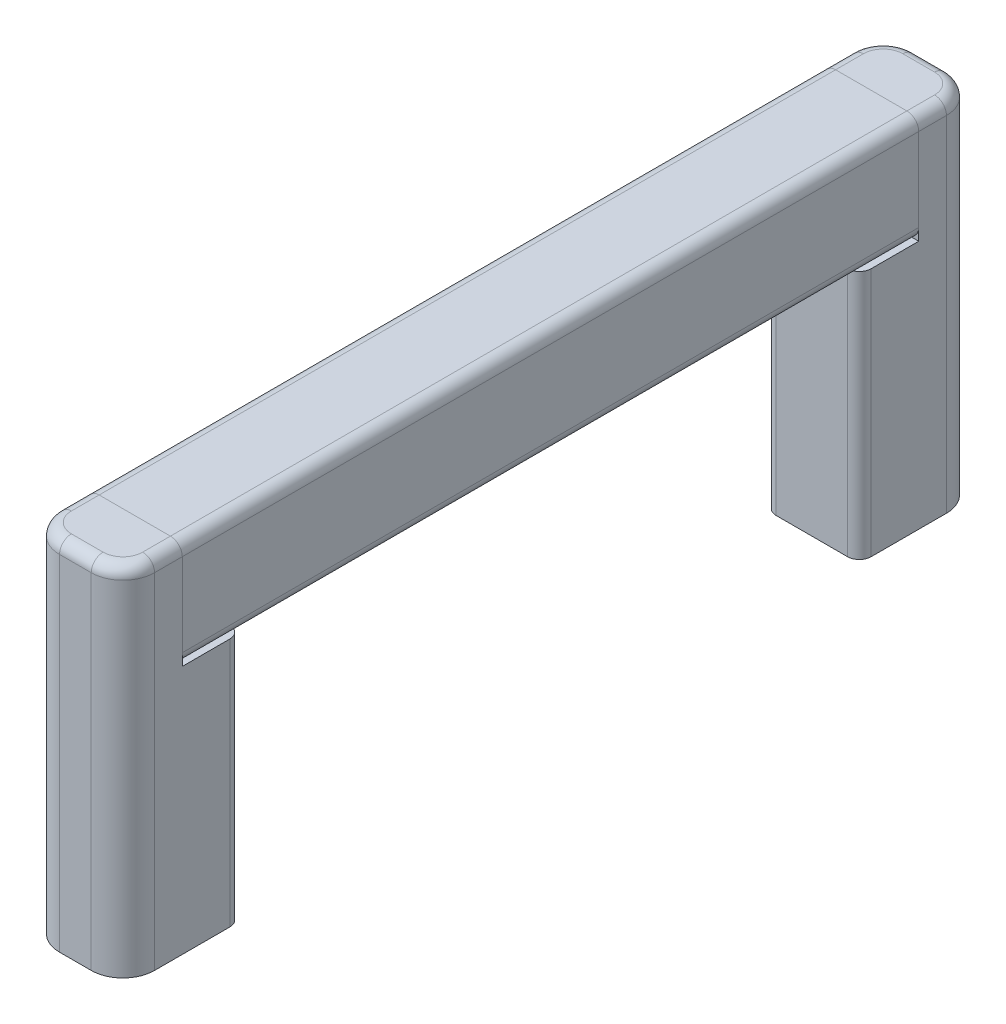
ISO-10303-21;
HEADER;
FILE_DESCRIPTION(('STEP AP214'),'2;1');
FILE_NAME('part.step','',(''),(''),'','','');
FILE_SCHEMA(('AUTOMOTIVE_DESIGN { 1 0 10303 214 1 1 1 1 }'));
ENDSEC;
DATA;
#1=APPLICATION_CONTEXT('core data for automotive mechanical design processes');
#2=APPLICATION_PROTOCOL_DEFINITION('international standard','automotive_design',2000,#1);
#3=PRODUCT_CONTEXT('',#1,'mechanical');
#4=PRODUCT('Part','Part','',(#3));
#5=PRODUCT_RELATED_PRODUCT_CATEGORY('part','',(#4));
#6=PRODUCT_DEFINITION_FORMATION('','',#4);
#7=PRODUCT_DEFINITION_CONTEXT('part definition',#1,'design');
#8=PRODUCT_DEFINITION('design','',#6,#7);
#9=PRODUCT_DEFINITION_SHAPE('','',#8);
#10=(LENGTH_UNIT() NAMED_UNIT(*) SI_UNIT(.MILLI.,.METRE.));
#11=(NAMED_UNIT(*) PLANE_ANGLE_UNIT() SI_UNIT($,.RADIAN.));
#12=(NAMED_UNIT(*) SI_UNIT($,.STERADIAN.) SOLID_ANGLE_UNIT());
#13=UNCERTAINTY_MEASURE_WITH_UNIT(LENGTH_MEASURE(1.E-05),#10,'distance_accuracy_value','');
#14=(GEOMETRIC_REPRESENTATION_CONTEXT(3) GLOBAL_UNCERTAINTY_ASSIGNED_CONTEXT((#13)) GLOBAL_UNIT_ASSIGNED_CONTEXT((#10,
#11,#12)) REPRESENTATION_CONTEXT('',''));
#15=CARTESIAN_POINT('',(0.,0.,0.));
#16=DIRECTION('',(0.,0.,1.));
#17=DIRECTION('',(1.,0.,0.));
#18=AXIS2_PLACEMENT_3D('',#15,#16,#17);
#19=CARTESIAN_POINT('',(-3.,3.50000000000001,31.));
#20=DIRECTION('',(0.,0.,1.));
#21=DIRECTION('',(1.,0.,0.));
#22=AXIS2_PLACEMENT_3D('',#19,#20,#21);
#23=PLANE('',#22);
#24=CARTESIAN_POINT('',(-3.,3.50000000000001,31.));
#25=DIRECTION('',(0.,0.,1.));
#26=DIRECTION('',(1.,0.,0.));
#27=AXIS2_PLACEMENT_3D('',#24,#25,#26);
#28=CIRCLE('',#27,1.);
#29=CARTESIAN_POINT('',(-3.,4.50000000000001,31.));
#30=VERTEX_POINT('',#29);
#31=CARTESIAN_POINT('',(-4.,3.50000000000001,31.));
#32=VERTEX_POINT('',#31);
#33=EDGE_CURVE('P0_E140',#30,#32,#28,.T.);
#34=ORIENTED_EDGE('',*,*,#33,.T.);
#35=DIRECTION('',(0.,-1.,0.));
#36=VECTOR('',#35,1.);
#37=CARTESIAN_POINT('',(-4.,3.50000000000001,31.));
#38=LINE('',#37,#36);
#39=CARTESIAN_POINT('',(-4.,-3.49999999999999,31.));
#40=VERTEX_POINT('',#39);
#41=EDGE_CURVE('P0_E129',#32,#40,#38,.T.);
#42=ORIENTED_EDGE('',*,*,#41,.T.);
#43=CARTESIAN_POINT('',(-3.,-3.49999999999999,31.));
#44=DIRECTION('',(0.,0.,1.));
#45=DIRECTION('',(1.,0.,0.));
#46=AXIS2_PLACEMENT_3D('',#43,#44,#45);
#47=CIRCLE('',#46,1.);
#48=CARTESIAN_POINT('',(-3.,-4.49999999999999,31.));
#49=VERTEX_POINT('',#48);
#50=EDGE_CURVE('P0_E139',#40,#49,#47,.T.);
#51=ORIENTED_EDGE('',*,*,#50,.T.);
#52=DIRECTION('',(1.,0.,0.));
#53=VECTOR('',#52,1.);
#54=CARTESIAN_POINT('',(-3.,-4.49999999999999,31.));
#55=LINE('',#54,#53);
#56=CARTESIAN_POINT('',(3.,-4.49999999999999,31.));
#57=VERTEX_POINT('',#56);
#58=EDGE_CURVE('P0_E224',#49,#57,#55,.T.);
#59=ORIENTED_EDGE('',*,*,#58,.T.);
#60=CARTESIAN_POINT('',(3.,-3.49999999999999,31.));
#61=DIRECTION('',(0.,0.,1.));
#62=DIRECTION('',(1.,0.,0.));
#63=AXIS2_PLACEMENT_3D('',#60,#61,#62);
#64=CIRCLE('',#63,1.);
#65=CARTESIAN_POINT('',(4.,-3.49999999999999,31.));
#66=VERTEX_POINT('',#65);
#67=EDGE_CURVE('P0_E226',#57,#66,#64,.T.);
#68=ORIENTED_EDGE('',*,*,#67,.T.);
#69=DIRECTION('',(0.,1.,0.));
#70=VECTOR('',#69,1.);
#71=CARTESIAN_POINT('',(4.,3.50000000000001,31.));
#72=LINE('',#71,#70);
#73=CARTESIAN_POINT('',(4.,3.50000000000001,31.));
#74=VERTEX_POINT('',#73);
#75=EDGE_CURVE('P0_E228',#66,#74,#72,.T.);
#76=ORIENTED_EDGE('',*,*,#75,.T.);
#77=CARTESIAN_POINT('',(3.,3.50000000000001,31.));
#78=DIRECTION('',(0.,0.,1.));
#79=DIRECTION('',(-1.,0.,0.));
#80=AXIS2_PLACEMENT_3D('',#77,#78,#79);
#81=CIRCLE('',#80,1.);
#82=CARTESIAN_POINT('',(3.,4.50000000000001,31.));
#83=VERTEX_POINT('',#82);
#84=EDGE_CURVE('P0_E230',#74,#83,#81,.T.);
#85=ORIENTED_EDGE('',*,*,#84,.T.);
#86=DIRECTION('',(-1.,0.,0.));
#87=VECTOR('',#86,1.);
#88=CARTESIAN_POINT('',(-3.,4.50000000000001,31.));
#89=LINE('',#88,#87);
#90=EDGE_CURVE('P0_E144',#83,#30,#89,.T.);
#91=ORIENTED_EDGE('',*,*,#90,.T.);
#92=EDGE_LOOP('',(#34,#42,#51,#59,#68,#76,#85,#91));
#93=FACE_BOUND('',#92,.T.);
#94=DIRECTION('',(-1.,0.,0.));
#95=VECTOR('',#94,1.);
#96=CARTESIAN_POINT('',(-1.33333333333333,1.5,31.));
#97=LINE('',#96,#95);
#98=CARTESIAN_POINT('',(0.833333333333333,1.5,31.));
#99=VERTEX_POINT('',#98);
#100=CARTESIAN_POINT('',(-0.833333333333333,1.5,31.));
#101=VERTEX_POINT('',#100);
#102=EDGE_CURVE('P0_E206',#99,#101,#97,.T.);
#103=ORIENTED_EDGE('',*,*,#102,.F.);
#104=CARTESIAN_POINT('',(0.833333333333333,1.,31.));
#105=DIRECTION('',(0.,0.,1.));
#106=DIRECTION('',(1.,0.,0.));
#107=AXIS2_PLACEMENT_3D('',#104,#105,#106);
#108=CIRCLE('',#107,0.5);
#109=CARTESIAN_POINT('',(1.33333333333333,1.,31.));
#110=VERTEX_POINT('',#109);
#111=EDGE_CURVE('P0_E187',#99,#110,#108,.F.);
#112=ORIENTED_EDGE('',*,*,#111,.T.);
#113=DIRECTION('',(0.,1.,0.));
#114=VECTOR('',#113,1.);
#115=CARTESIAN_POINT('',(1.33333333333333,-1.5,31.));
#116=LINE('',#115,#114);
#117=CARTESIAN_POINT('',(1.33333333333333,-0.999999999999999,31.));
#118=VERTEX_POINT('',#117);
#119=EDGE_CURVE('P0_E209',#118,#110,#116,.T.);
#120=ORIENTED_EDGE('',*,*,#119,.F.);
#121=CARTESIAN_POINT('',(0.833333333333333,-0.999999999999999,31.));
#122=DIRECTION('',(0.,0.,1.));
#123=DIRECTION('',(1.,0.,0.));
#124=AXIS2_PLACEMENT_3D('',#121,#122,#123);
#125=CIRCLE('',#124,0.5);
#126=CARTESIAN_POINT('',(0.833333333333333,-1.5,31.));
#127=VERTEX_POINT('',#126);
#128=EDGE_CURVE('P0_E183',#118,#127,#125,.F.);
#129=ORIENTED_EDGE('',*,*,#128,.T.);
#130=DIRECTION('',(1.,0.,0.));
#131=VECTOR('',#130,1.);
#132=CARTESIAN_POINT('',(-1.33333333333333,-1.5,31.));
#133=LINE('',#132,#131);
#134=CARTESIAN_POINT('',(-0.833333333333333,-1.5,31.));
#135=VERTEX_POINT('',#134);
#136=EDGE_CURVE('P0_E211',#135,#127,#133,.T.);
#137=ORIENTED_EDGE('',*,*,#136,.F.);
#138=CARTESIAN_POINT('',(-0.833333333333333,-0.999999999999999,31.));
#139=DIRECTION('',(0.,0.,1.));
#140=DIRECTION('',(1.,0.,0.));
#141=AXIS2_PLACEMENT_3D('',#138,#139,#140);
#142=CIRCLE('',#141,0.5);
#143=CARTESIAN_POINT('',(-1.33333333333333,-0.999999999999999,31.));
#144=VERTEX_POINT('',#143);
#145=EDGE_CURVE('P0_E179',#135,#144,#142,.F.);
#146=ORIENTED_EDGE('',*,*,#145,.T.);
#147=DIRECTION('',(0.,-1.,0.));
#148=VECTOR('',#147,1.);
#149=CARTESIAN_POINT('',(-1.33333333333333,-1.5,31.));
#150=LINE('',#149,#148);
#151=CARTESIAN_POINT('',(-1.33333333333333,1.,31.));
#152=VERTEX_POINT('',#151);
#153=EDGE_CURVE('P0_E208',#152,#144,#150,.T.);
#154=ORIENTED_EDGE('',*,*,#153,.F.);
#155=CARTESIAN_POINT('',(-0.833333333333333,0.999999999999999,31.));
#156=DIRECTION('',(0.,0.,1.));
#157=DIRECTION('',(1.,0.,0.));
#158=AXIS2_PLACEMENT_3D('',#155,#156,#157);
#159=CIRCLE('',#158,0.5);
#160=EDGE_CURVE('P0_E11',#152,#101,#159,.F.);
#161=ORIENTED_EDGE('',*,*,#160,.T.);
#162=EDGE_LOOP('',(#103,#112,#120,#129,#137,#146,#154,#161));
#163=FACE_BOUND('',#162,.T.);
#164=ADVANCED_FACE('P0_F16',(#93,#163),#23,.T.);
#165=CARTESIAN_POINT('',(-3.,3.50000000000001,-31.));
#166=DIRECTION('',(0.,0.,1.));
#167=DIRECTION('',(1.,0.,0.));
#168=AXIS2_PLACEMENT_3D('',#165,#166,#167);
#169=PLANE('',#168);
#170=CARTESIAN_POINT('',(-3.,3.50000000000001,-31.));
#171=DIRECTION('',(0.,0.,1.));
#172=DIRECTION('',(1.,0.,0.));
#173=AXIS2_PLACEMENT_3D('',#170,#171,#172);
#174=CIRCLE('',#173,1.);
#175=CARTESIAN_POINT('',(-3.,4.50000000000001,-31.));
#176=VERTEX_POINT('',#175);
#177=CARTESIAN_POINT('',(-4.,3.50000000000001,-31.));
#178=VERTEX_POINT('',#177);
#179=EDGE_CURVE('P0_E152',#176,#178,#174,.T.);
#180=ORIENTED_EDGE('',*,*,#179,.F.);
#181=DIRECTION('',(-1.,0.,0.));
#182=VECTOR('',#181,1.);
#183=CARTESIAN_POINT('',(-3.,4.50000000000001,-31.));
#184=LINE('',#183,#182);
#185=CARTESIAN_POINT('',(3.,4.50000000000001,-31.));
#186=VERTEX_POINT('',#185);
#187=EDGE_CURVE('P0_E148',#186,#176,#184,.T.);
#188=ORIENTED_EDGE('',*,*,#187,.F.);
#189=CARTESIAN_POINT('',(3.,3.50000000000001,-31.));
#190=DIRECTION('',(0.,0.,1.));
#191=DIRECTION('',(-1.,0.,0.));
#192=AXIS2_PLACEMENT_3D('',#189,#190,#191);
#193=CIRCLE('',#192,1.);
#194=CARTESIAN_POINT('',(4.,3.50000000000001,-31.));
#195=VERTEX_POINT('',#194);
#196=EDGE_CURVE('P0_E245',#195,#186,#193,.T.);
#197=ORIENTED_EDGE('',*,*,#196,.F.);
#198=DIRECTION('',(0.,1.,0.));
#199=VECTOR('',#198,1.);
#200=CARTESIAN_POINT('',(4.,3.50000000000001,-31.));
#201=LINE('',#200,#199);
#202=CARTESIAN_POINT('',(4.,-3.49999999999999,-31.));
#203=VERTEX_POINT('',#202);
#204=EDGE_CURVE('P0_E243',#203,#195,#201,.T.);
#205=ORIENTED_EDGE('',*,*,#204,.F.);
#206=CARTESIAN_POINT('',(3.,-3.49999999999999,-31.));
#207=DIRECTION('',(0.,0.,1.));
#208=DIRECTION('',(1.,0.,0.));
#209=AXIS2_PLACEMENT_3D('',#206,#207,#208);
#210=CIRCLE('',#209,1.);
#211=CARTESIAN_POINT('',(3.,-4.49999999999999,-31.));
#212=VERTEX_POINT('',#211);
#213=EDGE_CURVE('P0_E241',#212,#203,#210,.T.);
#214=ORIENTED_EDGE('',*,*,#213,.F.);
#215=DIRECTION('',(1.,0.,0.));
#216=VECTOR('',#215,1.);
#217=CARTESIAN_POINT('',(-3.,-4.49999999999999,-31.));
#218=LINE('',#217,#216);
#219=CARTESIAN_POINT('',(-3.,-4.49999999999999,-31.));
#220=VERTEX_POINT('',#219);
#221=EDGE_CURVE('P0_E239',#220,#212,#218,.T.);
#222=ORIENTED_EDGE('',*,*,#221,.F.);
#223=CARTESIAN_POINT('',(-3.,-3.49999999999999,-31.));
#224=DIRECTION('',(0.,0.,1.));
#225=DIRECTION('',(1.,0.,0.));
#226=AXIS2_PLACEMENT_3D('',#223,#224,#225);
#227=CIRCLE('',#226,1.);
#228=CARTESIAN_POINT('',(-4.,-3.49999999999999,-31.));
#229=VERTEX_POINT('',#228);
#230=EDGE_CURVE('P0_E237',#229,#220,#227,.T.);
#231=ORIENTED_EDGE('',*,*,#230,.F.);
#232=DIRECTION('',(0.,-1.,0.));
#233=VECTOR('',#232,1.);
#234=CARTESIAN_POINT('',(-4.,3.50000000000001,-31.));
#235=LINE('',#234,#233);
#236=EDGE_CURVE('P0_E235',#178,#229,#235,.T.);
#237=ORIENTED_EDGE('',*,*,#236,.F.);
#238=EDGE_LOOP('',(#180,#188,#197,#205,#214,#222,#231,#237));
#239=FACE_BOUND('',#238,.T.);
#240=DIRECTION('',(1.,0.,0.));
#241=VECTOR('',#240,1.);
#242=CARTESIAN_POINT('',(-1.33333333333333,-1.5,-31.));
#243=LINE('',#242,#241);
#244=CARTESIAN_POINT('',(-0.833333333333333,-1.5,-31.));
#245=VERTEX_POINT('',#244);
#246=CARTESIAN_POINT('',(0.833333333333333,-1.5,-31.));
#247=VERTEX_POINT('',#246);
#248=EDGE_CURVE('P0_E203',#245,#247,#243,.T.);
#249=ORIENTED_EDGE('',*,*,#248,.T.);
#250=CARTESIAN_POINT('',(0.833333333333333,-0.999999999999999,-31.));
#251=DIRECTION('',(0.,0.,1.));
#252=DIRECTION('',(1.,0.,0.));
#253=AXIS2_PLACEMENT_3D('',#250,#251,#252);
#254=CIRCLE('',#253,0.5);
#255=CARTESIAN_POINT('',(1.33333333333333,-0.999999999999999,-31.));
#256=VERTEX_POINT('',#255);
#257=EDGE_CURVE('P0_E181',#247,#256,#254,.T.);
#258=ORIENTED_EDGE('',*,*,#257,.T.);
#259=DIRECTION('',(0.,1.,0.));
#260=VECTOR('',#259,1.);
#261=CARTESIAN_POINT('',(1.33333333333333,-1.5,-31.));
#262=LINE('',#261,#260);
#263=CARTESIAN_POINT('',(1.33333333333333,1.,-31.));
#264=VERTEX_POINT('',#263);
#265=EDGE_CURVE('P0_E218',#256,#264,#262,.T.);
#266=ORIENTED_EDGE('',*,*,#265,.T.);
#267=CARTESIAN_POINT('',(0.833333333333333,1.,-31.));
#268=DIRECTION('',(0.,0.,1.));
#269=DIRECTION('',(1.,0.,0.));
#270=AXIS2_PLACEMENT_3D('',#267,#268,#269);
#271=CIRCLE('',#270,0.5);
#272=CARTESIAN_POINT('',(0.833333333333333,1.5,-31.));
#273=VERTEX_POINT('',#272);
#274=EDGE_CURVE('P0_E185',#264,#273,#271,.T.);
#275=ORIENTED_EDGE('',*,*,#274,.T.);
#276=DIRECTION('',(-1.,0.,0.));
#277=VECTOR('',#276,1.);
#278=CARTESIAN_POINT('',(-1.33333333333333,1.5,-31.));
#279=LINE('',#278,#277);
#280=CARTESIAN_POINT('',(-0.833333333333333,1.5,-31.));
#281=VERTEX_POINT('',#280);
#282=EDGE_CURVE('P0_E195',#273,#281,#279,.T.);
#283=ORIENTED_EDGE('',*,*,#282,.T.);
#284=CARTESIAN_POINT('',(-0.833333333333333,0.999999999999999,-31.));
#285=DIRECTION('',(0.,0.,1.));
#286=DIRECTION('',(1.,0.,0.));
#287=AXIS2_PLACEMENT_3D('',#284,#285,#286);
#288=CIRCLE('',#287,0.5);
#289=CARTESIAN_POINT('',(-1.33333333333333,1.,-31.));
#290=VERTEX_POINT('',#289);
#291=EDGE_CURVE('P0_E24',#281,#290,#288,.T.);
#292=ORIENTED_EDGE('',*,*,#291,.T.);
#293=DIRECTION('',(0.,-1.,0.));
#294=VECTOR('',#293,1.);
#295=CARTESIAN_POINT('',(-1.33333333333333,-1.5,-31.));
#296=LINE('',#295,#294);
#297=CARTESIAN_POINT('',(-1.33333333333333,-0.999999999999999,-31.));
#298=VERTEX_POINT('',#297);
#299=EDGE_CURVE('P0_E194',#290,#298,#296,.T.);
#300=ORIENTED_EDGE('',*,*,#299,.T.);
#301=CARTESIAN_POINT('',(-0.833333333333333,-0.999999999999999,-31.));
#302=DIRECTION('',(0.,0.,1.));
#303=DIRECTION('',(1.,0.,0.));
#304=AXIS2_PLACEMENT_3D('',#301,#302,#303);
#305=CIRCLE('',#304,0.5);
#306=EDGE_CURVE('P0_E177',#298,#245,#305,.T.);
#307=ORIENTED_EDGE('',*,*,#306,.T.);
#308=EDGE_LOOP('',(#249,#258,#266,#275,#283,#292,#300,#307));
#309=FACE_BOUND('',#308,.T.);
#310=ADVANCED_FACE('P0_F193',(#239,#309),#169,.F.);
#311=CARTESIAN_POINT('',(-3.,3.50000000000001,31.));
#312=DIRECTION('',(0.,0.,-1.));
#313=DIRECTION('',(-1.,0.,0.));
#314=AXIS2_PLACEMENT_3D('',#311,#312,#313);
#315=CYLINDRICAL_SURFACE('',#314,1.);
#316=ORIENTED_EDGE('',*,*,#179,.T.);
#317=DIRECTION('',(0.,0.,-1.));
#318=VECTOR('',#317,1.);
#319=CARTESIAN_POINT('',(-4.,3.50000000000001,31.));
#320=LINE('',#319,#318);
#321=EDGE_CURVE('P0_E133',#32,#178,#320,.T.);
#322=ORIENTED_EDGE('',*,*,#321,.F.);
#323=ORIENTED_EDGE('',*,*,#33,.F.);
#324=DIRECTION('',(0.,0.,-1.));
#325=VECTOR('',#324,1.);
#326=CARTESIAN_POINT('',(-3.,4.50000000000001,31.));
#327=LINE('',#326,#325);
#328=EDGE_CURVE('P0_E233',#30,#176,#327,.T.);
#329=ORIENTED_EDGE('',*,*,#328,.T.);
#330=EDGE_LOOP('',(#316,#322,#323,#329));
#331=FACE_BOUND('',#330,.T.);
#332=ADVANCED_FACE('P0_F150',(#331),#315,.T.);
#333=CARTESIAN_POINT('',(-4.,3.50000000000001,31.));
#334=DIRECTION('',(1.,0.,0.));
#335=DIRECTION('',(0.,0.,-1.));
#336=AXIS2_PLACEMENT_3D('',#333,#334,#335);
#337=PLANE('',#336);
#338=ORIENTED_EDGE('',*,*,#236,.T.);
#339=DIRECTION('',(0.,0.,-1.));
#340=VECTOR('',#339,1.);
#341=CARTESIAN_POINT('',(-4.,-3.49999999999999,31.));
#342=LINE('',#341,#340);
#343=EDGE_CURVE('P0_E136',#40,#229,#342,.T.);
#344=ORIENTED_EDGE('',*,*,#343,.F.);
#345=ORIENTED_EDGE('',*,*,#41,.F.);
#346=ORIENTED_EDGE('',*,*,#321,.T.);
#347=EDGE_LOOP('',(#338,#344,#345,#346));
#348=FACE_BOUND('',#347,.T.);
#349=ADVANCED_FACE('P0_F131',(#348),#337,.F.);
#350=CARTESIAN_POINT('',(-3.,-3.49999999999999,31.));
#351=DIRECTION('',(0.,0.,-1.));
#352=DIRECTION('',(-1.,0.,0.));
#353=AXIS2_PLACEMENT_3D('',#350,#351,#352);
#354=CYLINDRICAL_SURFACE('',#353,1.);
#355=ORIENTED_EDGE('',*,*,#230,.T.);
#356=DIRECTION('',(0.,0.,-1.));
#357=VECTOR('',#356,1.);
#358=CARTESIAN_POINT('',(-3.,-4.49999999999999,31.));
#359=LINE('',#358,#357);
#360=EDGE_CURVE('P0_E157',#49,#220,#359,.T.);
#361=ORIENTED_EDGE('',*,*,#360,.F.);
#362=ORIENTED_EDGE('',*,*,#50,.F.);
#363=ORIENTED_EDGE('',*,*,#343,.T.);
#364=EDGE_LOOP('',(#355,#361,#362,#363));
#365=FACE_BOUND('',#364,.T.);
#366=ADVANCED_FACE('P0_F283',(#365),#354,.T.);
#367=CARTESIAN_POINT('',(-3.,-4.49999999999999,31.));
#368=DIRECTION('',(0.,1.,0.));
#369=DIRECTION('',(0.,0.,1.));
#370=AXIS2_PLACEMENT_3D('',#367,#368,#369);
#371=PLANE('',#370);
#372=ORIENTED_EDGE('',*,*,#221,.T.);
#373=DIRECTION('',(0.,0.,-1.));
#374=VECTOR('',#373,1.);
#375=CARTESIAN_POINT('',(3.,-4.49999999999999,31.));
#376=LINE('',#375,#374);
#377=EDGE_CURVE('P0_E258',#57,#212,#376,.T.);
#378=ORIENTED_EDGE('',*,*,#377,.F.);
#379=ORIENTED_EDGE('',*,*,#58,.F.);
#380=ORIENTED_EDGE('',*,*,#360,.T.);
#381=EDGE_LOOP('',(#372,#378,#379,#380));
#382=FACE_BOUND('',#381,.T.);
#383=ADVANCED_FACE('P0_F265',(#382),#371,.F.);
#384=CARTESIAN_POINT('',(3.,-3.49999999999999,31.));
#385=DIRECTION('',(0.,0.,-1.));
#386=DIRECTION('',(-1.,0.,0.));
#387=AXIS2_PLACEMENT_3D('',#384,#385,#386);
#388=CYLINDRICAL_SURFACE('',#387,1.);
#389=ORIENTED_EDGE('',*,*,#213,.T.);
#390=DIRECTION('',(0.,0.,-1.));
#391=VECTOR('',#390,1.);
#392=CARTESIAN_POINT('',(4.,-3.49999999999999,31.));
#393=LINE('',#392,#391);
#394=EDGE_CURVE('P0_E255',#66,#203,#393,.T.);
#395=ORIENTED_EDGE('',*,*,#394,.F.);
#396=ORIENTED_EDGE('',*,*,#67,.F.);
#397=ORIENTED_EDGE('',*,*,#377,.T.);
#398=EDGE_LOOP('',(#389,#395,#396,#397));
#399=FACE_BOUND('',#398,.T.);
#400=ADVANCED_FACE('P0_F275',(#399),#388,.T.);
#401=CARTESIAN_POINT('',(4.,3.50000000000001,31.));
#402=DIRECTION('',(-1.,0.,0.));
#403=DIRECTION('',(0.,0.,1.));
#404=AXIS2_PLACEMENT_3D('',#401,#402,#403);
#405=PLANE('',#404);
#406=ORIENTED_EDGE('',*,*,#204,.T.);
#407=DIRECTION('',(0.,0.,-1.));
#408=VECTOR('',#407,1.);
#409=CARTESIAN_POINT('',(4.,3.50000000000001,31.));
#410=LINE('',#409,#408);
#411=EDGE_CURVE('P0_E252',#74,#195,#410,.T.);
#412=ORIENTED_EDGE('',*,*,#411,.F.);
#413=ORIENTED_EDGE('',*,*,#75,.F.);
#414=ORIENTED_EDGE('',*,*,#394,.T.);
#415=EDGE_LOOP('',(#406,#412,#413,#414));
#416=FACE_BOUND('',#415,.T.);
#417=ADVANCED_FACE('P0_F279',(#416),#405,.F.);
#418=CARTESIAN_POINT('',(3.,3.50000000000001,31.));
#419=DIRECTION('',(0.,0.,-1.));
#420=DIRECTION('',(-1.,0.,0.));
#421=AXIS2_PLACEMENT_3D('',#418,#419,#420);
#422=CYLINDRICAL_SURFACE('',#421,1.);
#423=ORIENTED_EDGE('',*,*,#196,.T.);
#424=DIRECTION('',(0.,0.,-1.));
#425=VECTOR('',#424,1.);
#426=CARTESIAN_POINT('',(3.,4.50000000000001,31.));
#427=LINE('',#426,#425);
#428=EDGE_CURVE('P0_E249',#83,#186,#427,.T.);
#429=ORIENTED_EDGE('',*,*,#428,.F.);
#430=ORIENTED_EDGE('',*,*,#84,.F.);
#431=ORIENTED_EDGE('',*,*,#411,.T.);
#432=EDGE_LOOP('',(#423,#429,#430,#431));
#433=FACE_BOUND('',#432,.T.);
#434=ADVANCED_FACE('P0_F306',(#433),#422,.T.);
#435=CARTESIAN_POINT('',(-3.,4.50000000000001,31.));
#436=DIRECTION('',(0.,-1.,0.));
#437=DIRECTION('',(0.,0.,-1.));
#438=AXIS2_PLACEMENT_3D('',#435,#436,#437);
#439=PLANE('',#438);
#440=ORIENTED_EDGE('',*,*,#187,.T.);
#441=ORIENTED_EDGE('',*,*,#328,.F.);
#442=ORIENTED_EDGE('',*,*,#90,.F.);
#443=ORIENTED_EDGE('',*,*,#428,.T.);
#444=EDGE_LOOP('',(#440,#441,#442,#443));
#445=FACE_BOUND('',#444,.T.);
#446=ADVANCED_FACE('P0_F303',(#445),#439,.F.);
#447=CARTESIAN_POINT('',(1.33333333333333,-1.5,31.));
#448=DIRECTION('',(-1.,0.,0.));
#449=DIRECTION('',(0.,0.,1.));
#450=AXIS2_PLACEMENT_3D('',#447,#448,#449);
#451=PLANE('',#450);
#452=ORIENTED_EDGE('',*,*,#265,.F.);
#453=DIRECTION('',(0.,0.,-1.));
#454=VECTOR('',#453,1.);
#455=CARTESIAN_POINT('',(1.33333333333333,-0.999999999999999,31.));
#456=LINE('',#455,#454);
#457=EDGE_CURVE('P0_E171',#256,#118,#456,.F.);
#458=ORIENTED_EDGE('',*,*,#457,.T.);
#459=ORIENTED_EDGE('',*,*,#119,.T.);
#460=DIRECTION('',(0.,0.,-1.));
#461=VECTOR('',#460,1.);
#462=CARTESIAN_POINT('',(1.33333333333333,1.,-31.));
#463=LINE('',#462,#461);
#464=EDGE_CURVE('P0_E168',#110,#264,#463,.T.);
#465=ORIENTED_EDGE('',*,*,#464,.T.);
#466=EDGE_LOOP('',(#452,#458,#459,#465));
#467=FACE_BOUND('',#466,.T.);
#468=ADVANCED_FACE('P0_F300',(#467),#451,.T.);
#469=CARTESIAN_POINT('',(-1.33333333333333,1.5,31.));
#470=DIRECTION('',(0.,-1.,0.));
#471=DIRECTION('',(1.,0.,0.));
#472=AXIS2_PLACEMENT_3D('',#469,#470,#471);
#473=PLANE('',#472);
#474=ORIENTED_EDGE('',*,*,#282,.F.);
#475=DIRECTION('',(0.,0.,-1.));
#476=VECTOR('',#475,1.);
#477=CARTESIAN_POINT('',(0.833333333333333,1.5,31.));
#478=LINE('',#477,#476);
#479=EDGE_CURVE('P0_E36',#273,#99,#478,.F.);
#480=ORIENTED_EDGE('',*,*,#479,.T.);
#481=ORIENTED_EDGE('',*,*,#102,.T.);
#482=DIRECTION('',(0.,0.,-1.));
#483=VECTOR('',#482,1.);
#484=CARTESIAN_POINT('',(-0.833333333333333,1.5,-31.));
#485=LINE('',#484,#483);
#486=EDGE_CURVE('P0_E173',#101,#281,#485,.T.);
#487=ORIENTED_EDGE('',*,*,#486,.T.);
#488=EDGE_LOOP('',(#474,#480,#481,#487));
#489=FACE_BOUND('',#488,.T.);
#490=ADVANCED_FACE('P0_F205',(#489),#473,.T.);
#491=CARTESIAN_POINT('',(-1.33333333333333,-1.5,31.));
#492=DIRECTION('',(1.,0.,0.));
#493=DIRECTION('',(0.,0.,-1.));
#494=AXIS2_PLACEMENT_3D('',#491,#492,#493);
#495=PLANE('',#494);
#496=ORIENTED_EDGE('',*,*,#153,.T.);
#497=DIRECTION('',(0.,0.,-1.));
#498=VECTOR('',#497,1.);
#499=CARTESIAN_POINT('',(-1.33333333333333,-0.999999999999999,-31.));
#500=LINE('',#499,#498);
#501=EDGE_CURVE('P0_E155',#144,#298,#500,.T.);
#502=ORIENTED_EDGE('',*,*,#501,.T.);
#503=ORIENTED_EDGE('',*,*,#299,.F.);
#504=DIRECTION('',(0.,0.,-1.));
#505=VECTOR('',#504,1.);
#506=CARTESIAN_POINT('',(-1.33333333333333,0.999999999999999,31.));
#507=LINE('',#506,#505);
#508=EDGE_CURVE('P0_E153',#290,#152,#507,.F.);
#509=ORIENTED_EDGE('',*,*,#508,.T.);
#510=EDGE_LOOP('',(#496,#502,#503,#509));
#511=FACE_BOUND('',#510,.T.);
#512=ADVANCED_FACE('P0_F201',(#511),#495,.T.);
#513=CARTESIAN_POINT('',(-1.33333333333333,-1.5,31.));
#514=DIRECTION('',(0.,1.,0.));
#515=DIRECTION('',(0.,0.,1.));
#516=AXIS2_PLACEMENT_3D('',#513,#514,#515);
#517=PLANE('',#516);
#518=ORIENTED_EDGE('',*,*,#248,.F.);
#519=DIRECTION('',(0.,0.,-1.));
#520=VECTOR('',#519,1.);
#521=CARTESIAN_POINT('',(-0.833333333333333,-1.5,31.));
#522=LINE('',#521,#520);
#523=EDGE_CURVE('P0_E166',#245,#135,#522,.F.);
#524=ORIENTED_EDGE('',*,*,#523,.T.);
#525=ORIENTED_EDGE('',*,*,#136,.T.);
#526=DIRECTION('',(0.,0.,-1.));
#527=VECTOR('',#526,1.);
#528=CARTESIAN_POINT('',(0.833333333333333,-1.5,-31.));
#529=LINE('',#528,#527);
#530=EDGE_CURVE('P0_E163',#127,#247,#529,.T.);
#531=ORIENTED_EDGE('',*,*,#530,.T.);
#532=EDGE_LOOP('',(#518,#524,#525,#531));
#533=FACE_BOUND('',#532,.T.);
#534=ADVANCED_FACE('P0_F355',(#533),#517,.T.);
#535=CARTESIAN_POINT('',(-0.833333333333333,-0.999999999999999,31.));
#536=DIRECTION('',(0.,0.,1.));
#537=DIRECTION('',(1.,0.,0.));
#538=AXIS2_PLACEMENT_3D('',#535,#536,#537);
#539=CYLINDRICAL_SURFACE('',#538,0.5);
#540=ORIENTED_EDGE('',*,*,#145,.F.);
#541=ORIENTED_EDGE('',*,*,#523,.F.);
#542=ORIENTED_EDGE('',*,*,#306,.F.);
#543=ORIENTED_EDGE('',*,*,#501,.F.);
#544=EDGE_LOOP('',(#540,#541,#542,#543));
#545=FACE_BOUND('',#544,.T.);
#546=ADVANCED_FACE('P0_F363',(#545),#539,.F.);
#547=CARTESIAN_POINT('',(0.833333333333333,-0.999999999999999,31.));
#548=DIRECTION('',(0.,0.,1.));
#549=DIRECTION('',(1.,0.,0.));
#550=AXIS2_PLACEMENT_3D('',#547,#548,#549);
#551=CYLINDRICAL_SURFACE('',#550,0.5);
#552=ORIENTED_EDGE('',*,*,#128,.F.);
#553=ORIENTED_EDGE('',*,*,#457,.F.);
#554=ORIENTED_EDGE('',*,*,#257,.F.);
#555=ORIENTED_EDGE('',*,*,#530,.F.);
#556=EDGE_LOOP('',(#552,#553,#554,#555));
#557=FACE_BOUND('',#556,.T.);
#558=ADVANCED_FACE('P0_F372',(#557),#551,.F.);
#559=CARTESIAN_POINT('',(0.833333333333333,1.,31.));
#560=DIRECTION('',(0.,0.,1.));
#561=DIRECTION('',(1.,0.,0.));
#562=AXIS2_PLACEMENT_3D('',#559,#560,#561);
#563=CYLINDRICAL_SURFACE('',#562,0.5);
#564=ORIENTED_EDGE('',*,*,#111,.F.);
#565=ORIENTED_EDGE('',*,*,#479,.F.);
#566=ORIENTED_EDGE('',*,*,#274,.F.);
#567=ORIENTED_EDGE('',*,*,#464,.F.);
#568=EDGE_LOOP('',(#564,#565,#566,#567));
#569=FACE_BOUND('',#568,.T.);
#570=ADVANCED_FACE('P0_F381',(#569),#563,.F.);
#571=CARTESIAN_POINT('',(-0.833333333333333,0.999999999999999,31.));
#572=DIRECTION('',(0.,0.,1.));
#573=DIRECTION('',(1.,0.,0.));
#574=AXIS2_PLACEMENT_3D('',#571,#572,#573);
#575=CYLINDRICAL_SURFACE('',#574,0.5);
#576=ORIENTED_EDGE('',*,*,#160,.F.);
#577=ORIENTED_EDGE('',*,*,#508,.F.);
#578=ORIENTED_EDGE('',*,*,#291,.F.);
#579=ORIENTED_EDGE('',*,*,#486,.F.);
#580=EDGE_LOOP('',(#576,#577,#578,#579));
#581=FACE_BOUND('',#580,.T.);
#582=ADVANCED_FACE('P0_F18',(#581),#575,.F.);
#583=CLOSED_SHELL('',(#164,#310,#332,#349,#366,#383,#400,#417,#434,#446,#468,#490,#512,#534,
#546,#558,#570,#582));
#584=MANIFOLD_SOLID_BREP('P0_B1',#583);
#585=CARTESIAN_POINT('',(0.,-25.5,-31.));
#586=DIRECTION('',(0.,1.,0.));
#587=DIRECTION('',(-1.,0.,0.));
#588=AXIS2_PLACEMENT_3D('',#585,#586,#587);
#589=CYLINDRICAL_SURFACE('',#588,3.24999999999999);
#590=CARTESIAN_POINT('',(0.,-11.2769088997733,-31.));
#591=DIRECTION('',(0.,1.,0.));
#592=DIRECTION('',(-1.,0.,0.));
#593=AXIS2_PLACEMENT_3D('',#590,#591,#592);
#594=CIRCLE('',#593,3.24999999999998);
#595=CARTESIAN_POINT('',(-3.24999999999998,-11.2769088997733,-31.));
#596=VERTEX_POINT('',#595);
#597=EDGE_CURVE('P1_E11',#596,#596,#594,.T.);
#598=ORIENTED_EDGE('',*,*,#597,.F.);
#599=EDGE_LOOP('',(#598));
#600=FACE_BOUND('',#599,.T.);
#601=CARTESIAN_POINT('',(0.,-25.5,-31.));
#602=DIRECTION('',(0.,1.,0.));
#603=DIRECTION('',(-1.,0.,0.));
#604=AXIS2_PLACEMENT_3D('',#601,#602,#603);
#605=CIRCLE('',#604,3.25);
#606=CARTESIAN_POINT('',(-3.25,-25.5,-31.));
#607=VERTEX_POINT('',#606);
#608=EDGE_CURVE('P1_E51',#607,#607,#605,.T.);
#609=ORIENTED_EDGE('',*,*,#608,.T.);
#610=EDGE_LOOP('',(#609));
#611=FACE_BOUND('',#610,.T.);
#612=ADVANCED_FACE('P1_F16',(#600,#611),#589,.T.);
#613=CARTESIAN_POINT('',(0.,-11.2769088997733,-31.));
#614=DIRECTION('',(0.,1.,0.));
#615=DIRECTION('',(-1.,0.,0.));
#616=AXIS2_PLACEMENT_3D('',#613,#614,#615);
#617=TOROIDAL_SURFACE('',#616,2.25,0.999999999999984);
#618=CARTESIAN_POINT('',(0.,-10.2807142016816,-31.));
#619=DIRECTION('',(0.,1.,0.));
#620=DIRECTION('',(-1.,0.,0.));
#621=AXIS2_PLACEMENT_3D('',#618,#619,#620);
#622=CIRCLE('',#621,2.33715574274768);
#623=CARTESIAN_POINT('',(-2.33715574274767,-10.2807142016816,-31.));
#624=VERTEX_POINT('',#623);
#625=EDGE_CURVE('P1_E23',#624,#624,#622,.T.);
#626=ORIENTED_EDGE('',*,*,#625,.F.);
#627=EDGE_LOOP('',(#626));
#628=FACE_BOUND('',#627,.T.);
#629=ORIENTED_EDGE('',*,*,#597,.T.);
#630=EDGE_LOOP('',(#629));
#631=FACE_BOUND('',#630,.T.);
#632=ADVANCED_FACE('P1_F33',(#628,#631),#617,.T.);
#633=CARTESIAN_POINT('',(0.,-10.2807142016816,-31.));
#634=DIRECTION('',(0.,-1.,0.));
#635=DIRECTION('',(1.,0.,0.));
#636=AXIS2_PLACEMENT_3D('',#633,#634,#635);
#637=CONICAL_SURFACE('',#636,2.33715574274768,1.48352986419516);
#638=CARTESIAN_POINT('',(0.,-10.0762395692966,-31.));
#639=VERTEX_POINT('',#638);
#640=VERTEX_LOOP('',#639);
#641=FACE_BOUND('',#640,.T.);
#642=ORIENTED_EDGE('',*,*,#625,.T.);
#643=EDGE_LOOP('',(#642));
#644=FACE_BOUND('',#643,.T.);
#645=ADVANCED_FACE('P1_F29',(#641,#644),#637,.T.);
#646=CARTESIAN_POINT('',(0.,-13.5762395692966,-31.));
#647=DIRECTION('',(0.,-1.,0.));
#648=DIRECTION('',(1.,0.,0.));
#649=AXIS2_PLACEMENT_3D('',#646,#647,#648);
#650=CONICAL_SURFACE('',#649,0.,1.04719755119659);
#651=CARTESIAN_POINT('',(0.,-14.5,-31.));
#652=DIRECTION('',(0.,1.,0.));
#653=DIRECTION('',(-1.,0.,0.));
#654=AXIS2_PLACEMENT_3D('',#651,#652,#653);
#655=CIRCLE('',#654,1.6);
#656=CARTESIAN_POINT('',(-1.6,-14.5,-31.));
#657=VERTEX_POINT('',#656);
#658=EDGE_CURVE('P1_E38',#657,#657,#655,.T.);
#659=ORIENTED_EDGE('',*,*,#658,.F.);
#660=EDGE_LOOP('',(#659));
#661=FACE_BOUND('',#660,.T.);
#662=CARTESIAN_POINT('',(0.,-13.5762395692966,-31.));
#663=VERTEX_POINT('',#662);
#664=VERTEX_LOOP('',#663);
#665=FACE_BOUND('',#664,.T.);
#666=ADVANCED_FACE('P1_F32',(#661,#665),#650,.F.);
#667=CARTESIAN_POINT('',(0.,-25.5,-31.));
#668=DIRECTION('',(0.,1.,0.));
#669=DIRECTION('',(-1.,0.,0.));
#670=AXIS2_PLACEMENT_3D('',#667,#668,#669);
#671=CYLINDRICAL_SURFACE('',#670,1.6);
#672=CARTESIAN_POINT('',(0.,-17.5,-31.));
#673=DIRECTION('',(0.,1.,0.));
#674=DIRECTION('',(-1.,0.,0.));
#675=AXIS2_PLACEMENT_3D('',#672,#673,#674);
#676=CIRCLE('',#675,1.6);
#677=CARTESIAN_POINT('',(-1.6,-17.5,-31.));
#678=VERTEX_POINT('',#677);
#679=EDGE_CURVE('P1_E40',#678,#678,#676,.T.);
#680=ORIENTED_EDGE('',*,*,#679,.F.);
#681=EDGE_LOOP('',(#680));
#682=FACE_BOUND('',#681,.T.);
#683=ORIENTED_EDGE('',*,*,#658,.T.);
#684=EDGE_LOOP('',(#683));
#685=FACE_BOUND('',#684,.T.);
#686=ADVANCED_FACE('P1_F71',(#682,#685),#671,.F.);
#687=CARTESIAN_POINT('',(0.,-17.5,-29.));
#688=DIRECTION('',(0.,1.,0.));
#689=DIRECTION('',(-1.,0.,0.));
#690=AXIS2_PLACEMENT_3D('',#687,#688,#689);
#691=PLANE('',#690);
#692=CARTESIAN_POINT('',(0.,-17.5,-31.));
#693=DIRECTION('',(0.,1.,0.));
#694=DIRECTION('',(-1.,0.,0.));
#695=AXIS2_PLACEMENT_3D('',#692,#693,#694);
#696=CIRCLE('',#695,2.);
#697=CARTESIAN_POINT('',(-2.,-17.5,-31.));
#698=VERTEX_POINT('',#697);
#699=EDGE_CURVE('P1_E45',#698,#698,#696,.T.);
#700=ORIENTED_EDGE('',*,*,#699,.F.);
#701=EDGE_LOOP('',(#700));
#702=FACE_BOUND('',#701,.T.);
#703=ORIENTED_EDGE('',*,*,#679,.T.);
#704=EDGE_LOOP('',(#703));
#705=FACE_BOUND('',#704,.T.);
#706=ADVANCED_FACE('P1_F65',(#702,#705),#691,.F.);
#707=CARTESIAN_POINT('',(0.,-25.5,-31.));
#708=DIRECTION('',(0.,1.,0.));
#709=DIRECTION('',(-1.,0.,0.));
#710=AXIS2_PLACEMENT_3D('',#707,#708,#709);
#711=CYLINDRICAL_SURFACE('',#710,2.);
#712=CARTESIAN_POINT('',(0.,-25.5,-31.));
#713=DIRECTION('',(0.,1.,0.));
#714=DIRECTION('',(-1.,0.,0.));
#715=AXIS2_PLACEMENT_3D('',#712,#713,#714);
#716=CIRCLE('',#715,2.);
#717=CARTESIAN_POINT('',(-2.,-25.5,-31.));
#718=VERTEX_POINT('',#717);
#719=EDGE_CURVE('P1_E48',#718,#718,#716,.T.);
#720=ORIENTED_EDGE('',*,*,#719,.F.);
#721=EDGE_LOOP('',(#720));
#722=FACE_BOUND('',#721,.T.);
#723=ORIENTED_EDGE('',*,*,#699,.T.);
#724=EDGE_LOOP('',(#723));
#725=FACE_BOUND('',#724,.T.);
#726=ADVANCED_FACE('P1_F59',(#722,#725),#711,.F.);
#727=CARTESIAN_POINT('',(0.,-25.5,-29.));
#728=DIRECTION('',(0.,1.,0.));
#729=DIRECTION('',(-1.,0.,0.));
#730=AXIS2_PLACEMENT_3D('',#727,#728,#729);
#731=PLANE('',#730);
#732=ORIENTED_EDGE('',*,*,#608,.F.);
#733=EDGE_LOOP('',(#732));
#734=FACE_BOUND('',#733,.T.);
#735=ORIENTED_EDGE('',*,*,#719,.T.);
#736=EDGE_LOOP('',(#735));
#737=FACE_BOUND('',#736,.T.);
#738=ADVANCED_FACE('P1_F56',(#734,#737),#731,.F.);
#739=CLOSED_SHELL('',(#612,#632,#645,#666,#686,#706,#726,#738));
#740=MANIFOLD_SOLID_BREP('P1_B1',#739);
#741=CARTESIAN_POINT('',(-1.33333333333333,-25.5,-33.3333333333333));
#742=DIRECTION('',(0.,1.,0.));
#743=DIRECTION('',(-1.,0.,0.));
#744=AXIS2_PLACEMENT_3D('',#741,#742,#743);
#745=PLANE('',#744);
#746=DIRECTION('',(0.,0.,-1.));
#747=VECTOR('',#746,1.);
#748=CARTESIAN_POINT('',(4.,-25.5,-33.3333333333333));
#749=LINE('',#748,#747);
#750=CARTESIAN_POINT('',(4.,-25.5,-27.));
#751=VERTEX_POINT('',#750);
#752=CARTESIAN_POINT('',(4.,-25.5,-33.3333333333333));
#753=VERTEX_POINT('',#752);
#754=EDGE_CURVE('P2_E225',#751,#753,#749,.T.);
#755=ORIENTED_EDGE('',*,*,#754,.F.);
#756=CARTESIAN_POINT('',(3.,-25.5,-27.));
#757=DIRECTION('',(0.,1.,0.));
#758=DIRECTION('',(-1.,0.,0.));
#759=AXIS2_PLACEMENT_3D('',#756,#757,#758);
#760=CIRCLE('',#759,1.);
#761=CARTESIAN_POINT('',(3.,-25.5,-26.));
#762=VERTEX_POINT('',#761);
#763=EDGE_CURVE('P2_E276',#751,#762,#760,.F.);
#764=ORIENTED_EDGE('',*,*,#763,.T.);
#765=DIRECTION('',(1.,0.,0.));
#766=VECTOR('',#765,1.);
#767=CARTESIAN_POINT('',(4.,-25.5,-26.));
#768=LINE('',#767,#766);
#769=CARTESIAN_POINT('',(-3.,-25.5,-26.));
#770=VERTEX_POINT('',#769);
#771=EDGE_CURVE('P2_E220',#770,#762,#768,.T.);
#772=ORIENTED_EDGE('',*,*,#771,.F.);
#773=CARTESIAN_POINT('',(-3.,-25.5,-27.));
#774=DIRECTION('',(0.,1.,0.));
#775=DIRECTION('',(-1.,0.,0.));
#776=AXIS2_PLACEMENT_3D('',#773,#774,#775);
#777=CIRCLE('',#776,1.);
#778=CARTESIAN_POINT('',(-4.,-25.5,-27.));
#779=VERTEX_POINT('',#778);
#780=EDGE_CURVE('P2_E274',#770,#779,#777,.F.);
#781=ORIENTED_EDGE('',*,*,#780,.T.);
#782=DIRECTION('',(0.,0.,1.));
#783=VECTOR('',#782,1.);
#784=CARTESIAN_POINT('',(-4.,-25.5,-33.3333333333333));
#785=LINE('',#784,#783);
#786=CARTESIAN_POINT('',(-4.,-25.5,-33.3333333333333));
#787=VERTEX_POINT('',#786);
#788=EDGE_CURVE('P2_E237',#787,#779,#785,.T.);
#789=ORIENTED_EDGE('',*,*,#788,.F.);
#790=CARTESIAN_POINT('',(-1.33333333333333,-25.5,-33.3333333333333));
#791=DIRECTION('',(0.,1.,0.));
#792=DIRECTION('',(-1.,0.,0.));
#793=AXIS2_PLACEMENT_3D('',#790,#791,#792);
#794=CIRCLE('',#793,2.66666666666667);
#795=CARTESIAN_POINT('',(-1.33333333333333,-25.5,-36.));
#796=VERTEX_POINT('',#795);
#797=EDGE_CURVE('P2_E234',#796,#787,#794,.T.);
#798=ORIENTED_EDGE('',*,*,#797,.F.);
#799=DIRECTION('',(-1.,0.,0.));
#800=VECTOR('',#799,1.);
#801=CARTESIAN_POINT('',(1.33333333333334,-25.5,-36.));
#802=LINE('',#801,#800);
#803=CARTESIAN_POINT('',(1.33333333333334,-25.5,-36.));
#804=VERTEX_POINT('',#803);
#805=EDGE_CURVE('P2_E231',#804,#796,#802,.T.);
#806=ORIENTED_EDGE('',*,*,#805,.F.);
#807=CARTESIAN_POINT('',(1.33333333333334,-25.5,-33.3333333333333));
#808=DIRECTION('',(0.,1.,0.));
#809=DIRECTION('',(-1.,0.,0.));
#810=AXIS2_PLACEMENT_3D('',#807,#808,#809);
#811=CIRCLE('',#810,2.66666666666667);
#812=EDGE_CURVE('P2_E228',#753,#804,#811,.T.);
#813=ORIENTED_EDGE('',*,*,#812,.F.);
#814=EDGE_LOOP('',(#755,#764,#772,#781,#789,#798,#806,#813));
#815=FACE_BOUND('',#814,.T.);
#816=CARTESIAN_POINT('',(0.,-25.5,-31.));
#817=DIRECTION('',(0.,1.,0.));
#818=DIRECTION('',(0.,0.,-1.));
#819=AXIS2_PLACEMENT_3D('',#816,#817,#818);
#820=CIRCLE('',#819,3.25);
#821=CARTESIAN_POINT('',(0.,-25.5,-34.25));
#822=VERTEX_POINT('',#821);
#823=EDGE_CURVE('P2_E172',#822,#822,#820,.T.);
#824=ORIENTED_EDGE('',*,*,#823,.T.);
#825=EDGE_LOOP('',(#824));
#826=FACE_BOUND('',#825,.T.);
#827=ADVANCED_FACE('P2_F16',(#815,#826),#745,.F.);
#828=CARTESIAN_POINT('',(4.,-4.5,-31.));
#829=DIRECTION('',(0.,0.,-1.));
#830=DIRECTION('',(-1.,0.,0.));
#831=AXIS2_PLACEMENT_3D('',#828,#829,#830);
#832=PLANE('',#831);
#833=DIRECTION('',(0.,1.,0.));
#834=VECTOR('',#833,1.);
#835=CARTESIAN_POINT('',(4.,-4.5,-31.));
#836=LINE('',#835,#834);
#837=CARTESIAN_POINT('',(4.,-4.5,-31.));
#838=VERTEX_POINT('',#837);
#839=CARTESIAN_POINT('',(4.,3.5,-31.));
#840=VERTEX_POINT('',#839);
#841=EDGE_CURVE('P2_E217',#838,#840,#836,.T.);
#842=ORIENTED_EDGE('',*,*,#841,.T.);
#843=CARTESIAN_POINT('',(3.,3.5,-31.));
#844=DIRECTION('',(0.,0.,-1.));
#845=DIRECTION('',(-1.,0.,0.));
#846=AXIS2_PLACEMENT_3D('',#843,#844,#845);
#847=CIRCLE('',#846,1.);
#848=CARTESIAN_POINT('',(3.,4.5,-31.));
#849=VERTEX_POINT('',#848);
#850=EDGE_CURVE('P2_E266',#840,#849,#847,.F.);
#851=ORIENTED_EDGE('',*,*,#850,.T.);
#852=DIRECTION('',(-1.,0.,0.));
#853=VECTOR('',#852,1.);
#854=CARTESIAN_POINT('',(4.,4.5,-31.));
#855=LINE('',#854,#853);
#856=CARTESIAN_POINT('',(-3.,4.5,-31.));
#857=VERTEX_POINT('',#856);
#858=EDGE_CURVE('P2_E191',#849,#857,#855,.T.);
#859=ORIENTED_EDGE('',*,*,#858,.T.);
#860=CARTESIAN_POINT('',(-3.,3.5,-31.));
#861=DIRECTION('',(0.,0.,-1.));
#862=DIRECTION('',(-1.,0.,0.));
#863=AXIS2_PLACEMENT_3D('',#860,#861,#862);
#864=CIRCLE('',#863,1.);
#865=CARTESIAN_POINT('',(-4.,3.5,-31.));
#866=VERTEX_POINT('',#865);
#867=EDGE_CURVE('P2_E264',#857,#866,#864,.F.);
#868=ORIENTED_EDGE('',*,*,#867,.T.);
#869=DIRECTION('',(0.,1.,0.));
#870=VECTOR('',#869,1.);
#871=CARTESIAN_POINT('',(-4.,-4.5,-31.));
#872=LINE('',#871,#870);
#873=CARTESIAN_POINT('',(-4.,-4.5,-31.));
#874=VERTEX_POINT('',#873);
#875=EDGE_CURVE('P2_E214',#874,#866,#872,.T.);
#876=ORIENTED_EDGE('',*,*,#875,.F.);
#877=DIRECTION('',(-1.,0.,0.));
#878=VECTOR('',#877,1.);
#879=CARTESIAN_POINT('',(4.,-4.5,-31.));
#880=LINE('',#879,#878);
#881=EDGE_CURVE('P2_E203',#838,#874,#880,.T.);
#882=ORIENTED_EDGE('',*,*,#881,.F.);
#883=EDGE_LOOP('',(#842,#851,#859,#868,#876,#882));
#884=FACE_BOUND('',#883,.T.);
#885=DIRECTION('',(0.,-1.,0.));
#886=VECTOR('',#885,1.);
#887=CARTESIAN_POINT('',(-1.33333333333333,1.5,-31.));
#888=LINE('',#887,#886);
#889=CARTESIAN_POINT('',(-1.33333333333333,0.999999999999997,-31.));
#890=VERTEX_POINT('',#889);
#891=CARTESIAN_POINT('',(-1.33333333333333,-1.,-31.));
#892=VERTEX_POINT('',#891);
#893=EDGE_CURVE('P2_E192',#890,#892,#888,.T.);
#894=ORIENTED_EDGE('',*,*,#893,.F.);
#895=CARTESIAN_POINT('',(-0.833333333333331,0.999999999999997,-31.));
#896=DIRECTION('',(0.,0.,-1.));
#897=DIRECTION('',(-1.,0.,0.));
#898=AXIS2_PLACEMENT_3D('',#895,#896,#897);
#899=CIRCLE('',#898,0.5);
#900=CARTESIAN_POINT('',(-0.833333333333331,1.5,-31.));
#901=VERTEX_POINT('',#900);
#902=EDGE_CURVE('P2_E11',#890,#901,#899,.T.);
#903=ORIENTED_EDGE('',*,*,#902,.T.);
#904=DIRECTION('',(-1.,0.,0.));
#905=VECTOR('',#904,1.);
#906=CARTESIAN_POINT('',(-1.33333333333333,1.5,-31.));
#907=LINE('',#906,#905);
#908=CARTESIAN_POINT('',(0.833333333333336,1.5,-31.));
#909=VERTEX_POINT('',#908);
#910=EDGE_CURVE('P2_E182',#909,#901,#907,.T.);
#911=ORIENTED_EDGE('',*,*,#910,.F.);
#912=CARTESIAN_POINT('',(0.833333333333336,0.999999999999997,-31.));
#913=DIRECTION('',(0.,0.,-1.));
#914=DIRECTION('',(-1.,0.,0.));
#915=AXIS2_PLACEMENT_3D('',#912,#913,#914);
#916=CIRCLE('',#915,0.5);
#917=CARTESIAN_POINT('',(1.33333333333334,0.999999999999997,-31.));
#918=VERTEX_POINT('',#917);
#919=EDGE_CURVE('P2_E329',#909,#918,#916,.T.);
#920=ORIENTED_EDGE('',*,*,#919,.T.);
#921=DIRECTION('',(0.,1.,0.));
#922=VECTOR('',#921,1.);
#923=CARTESIAN_POINT('',(1.33333333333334,1.5,-31.));
#924=LINE('',#923,#922);
#925=CARTESIAN_POINT('',(1.33333333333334,-1.,-31.));
#926=VERTEX_POINT('',#925);
#927=EDGE_CURVE('P2_E198',#926,#918,#924,.T.);
#928=ORIENTED_EDGE('',*,*,#927,.F.);
#929=CARTESIAN_POINT('',(0.833333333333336,-1.,-31.));
#930=DIRECTION('',(0.,0.,-1.));
#931=DIRECTION('',(-1.,0.,0.));
#932=AXIS2_PLACEMENT_3D('',#929,#930,#931);
#933=CIRCLE('',#932,0.5);
#934=CARTESIAN_POINT('',(0.833333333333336,-1.5,-31.));
#935=VERTEX_POINT('',#934);
#936=EDGE_CURVE('P2_E327',#926,#935,#933,.T.);
#937=ORIENTED_EDGE('',*,*,#936,.T.);
#938=DIRECTION('',(1.,0.,0.));
#939=VECTOR('',#938,1.);
#940=CARTESIAN_POINT('',(-1.33333333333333,-1.5,-31.));
#941=LINE('',#940,#939);
#942=CARTESIAN_POINT('',(-0.833333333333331,-1.5,-31.));
#943=VERTEX_POINT('',#942);
#944=EDGE_CURVE('P2_E194',#943,#935,#941,.T.);
#945=ORIENTED_EDGE('',*,*,#944,.F.);
#946=CARTESIAN_POINT('',(-0.833333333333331,-1.,-31.));
#947=DIRECTION('',(0.,0.,-1.));
#948=DIRECTION('',(-1.,0.,0.));
#949=AXIS2_PLACEMENT_3D('',#946,#947,#948);
#950=CIRCLE('',#949,0.5);
#951=EDGE_CURVE('P2_E24',#943,#892,#950,.T.);
#952=ORIENTED_EDGE('',*,*,#951,.T.);
#953=EDGE_LOOP('',(#894,#903,#911,#920,#928,#937,#945,#952));
#954=FACE_BOUND('',#953,.T.);
#955=ADVANCED_FACE('P2_F332',(#884,#954),#832,.F.);
#956=CARTESIAN_POINT('',(4.,4.5,-26.));
#957=DIRECTION('',(0.,0.,-1.));
#958=DIRECTION('',(-1.,0.,0.));
#959=AXIS2_PLACEMENT_3D('',#956,#957,#958);
#960=PLANE('',#959);
#961=ORIENTED_EDGE('',*,*,#771,.T.);
#962=DIRECTION('',(0.,-1.,0.));
#963=VECTOR('',#962,1.);
#964=CARTESIAN_POINT('',(3.,4.5,-26.));
#965=LINE('',#964,#963);
#966=CARTESIAN_POINT('',(3.,-4.5,-26.));
#967=VERTEX_POINT('',#966);
#968=EDGE_CURVE('P2_E281',#762,#967,#965,.F.);
#969=ORIENTED_EDGE('',*,*,#968,.T.);
#970=DIRECTION('',(1.,0.,0.));
#971=VECTOR('',#970,1.);
#972=CARTESIAN_POINT('',(4.,-4.5,-26.));
#973=LINE('',#972,#971);
#974=CARTESIAN_POINT('',(-3.,-4.5,-26.));
#975=VERTEX_POINT('',#974);
#976=EDGE_CURVE('P2_E209',#975,#967,#973,.T.);
#977=ORIENTED_EDGE('',*,*,#976,.F.);
#978=DIRECTION('',(0.,-1.,0.));
#979=VECTOR('',#978,1.);
#980=CARTESIAN_POINT('',(-3.,4.5,-26.));
#981=LINE('',#980,#979);
#982=EDGE_CURVE('P2_E278',#975,#770,#981,.T.);
#983=ORIENTED_EDGE('',*,*,#982,.T.);
#984=EDGE_LOOP('',(#961,#969,#977,#983));
#985=FACE_BOUND('',#984,.T.);
#986=ADVANCED_FACE('P2_F376',(#985),#960,.F.);
#987=CARTESIAN_POINT('',(4.,4.5,-33.3333333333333));
#988=DIRECTION('',(-1.,0.,0.));
#989=DIRECTION('',(0.,0.,1.));
#990=AXIS2_PLACEMENT_3D('',#987,#988,#989);
#991=PLANE('',#990);
#992=DIRECTION('',(0.,-1.,0.));
#993=VECTOR('',#992,1.);
#994=CARTESIAN_POINT('',(4.,4.5,-33.3333333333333));
#995=LINE('',#994,#993);
#996=CARTESIAN_POINT('',(4.,3.5,-33.3333333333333));
#997=VERTEX_POINT('',#996);
#998=EDGE_CURVE('P2_E246',#997,#753,#995,.T.);
#999=ORIENTED_EDGE('',*,*,#998,.F.);
#1000=DIRECTION('',(0.,0.,-1.));
#1001=VECTOR('',#1000,1.);
#1002=CARTESIAN_POINT('',(4.,3.5,-31.));
#1003=LINE('',#1002,#1001);
#1004=EDGE_CURVE('P2_E262',#997,#840,#1003,.F.);
#1005=ORIENTED_EDGE('',*,*,#1004,.T.);
#1006=ORIENTED_EDGE('',*,*,#841,.F.);
#1007=DIRECTION('',(0.,0.,-1.));
#1008=VECTOR('',#1007,1.);
#1009=CARTESIAN_POINT('',(4.,-4.5,-31.));
#1010=LINE('',#1009,#1008);
#1011=CARTESIAN_POINT('',(4.,-4.5,-27.));
#1012=VERTEX_POINT('',#1011);
#1013=EDGE_CURVE('P2_E212',#1012,#838,#1010,.T.);
#1014=ORIENTED_EDGE('',*,*,#1013,.F.);
#1015=DIRECTION('',(0.,-1.,0.));
#1016=VECTOR('',#1015,1.);
#1017=CARTESIAN_POINT('',(4.,4.5,-27.));
#1018=LINE('',#1017,#1016);
#1019=EDGE_CURVE('P2_E259',#1012,#751,#1018,.T.);
#1020=ORIENTED_EDGE('',*,*,#1019,.T.);
#1021=ORIENTED_EDGE('',*,*,#754,.T.);
#1022=EDGE_LOOP('',(#999,#1005,#1006,#1014,#1020,#1021));
#1023=FACE_BOUND('',#1022,.T.);
#1024=ADVANCED_FACE('P2_F399',(#1023),#991,.F.);
#1025=CARTESIAN_POINT('',(1.33333333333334,4.5,-33.3333333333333));
#1026=DIRECTION('',(0.,-1.,0.));
#1027=DIRECTION('',(1.,0.,0.));
#1028=AXIS2_PLACEMENT_3D('',#1025,#1026,#1027);
#1029=CYLINDRICAL_SURFACE('',#1028,2.66666666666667);
#1030=DIRECTION('',(0.,-1.,0.));
#1031=VECTOR('',#1030,1.);
#1032=CARTESIAN_POINT('',(1.33333333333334,4.5,-36.));
#1033=LINE('',#1032,#1031);
#1034=CARTESIAN_POINT('',(1.33333333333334,3.5,-36.));
#1035=VERTEX_POINT('',#1034);
#1036=EDGE_CURVE('P2_E244',#1035,#804,#1033,.T.);
#1037=ORIENTED_EDGE('',*,*,#1036,.F.);
#1038=CARTESIAN_POINT('',(1.33333333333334,3.5,-33.3333333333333));
#1039=DIRECTION('',(0.,1.,0.));
#1040=DIRECTION('',(-1.,0.,0.));
#1041=AXIS2_PLACEMENT_3D('',#1038,#1039,#1040);
#1042=CIRCLE('',#1041,2.66666666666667);
#1043=EDGE_CURVE('P2_E268',#1035,#997,#1042,.F.);
#1044=ORIENTED_EDGE('',*,*,#1043,.T.);
#1045=ORIENTED_EDGE('',*,*,#998,.T.);
#1046=ORIENTED_EDGE('',*,*,#812,.T.);
#1047=EDGE_LOOP('',(#1037,#1044,#1045,#1046));
#1048=FACE_BOUND('',#1047,.T.);
#1049=ADVANCED_FACE('P2_F395',(#1048),#1029,.T.);
#1050=CARTESIAN_POINT('',(1.33333333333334,4.5,-36.));
#1051=DIRECTION('',(0.,0.,1.));
#1052=DIRECTION('',(1.,0.,0.));
#1053=AXIS2_PLACEMENT_3D('',#1050,#1051,#1052);
#1054=PLANE('',#1053);
#1055=DIRECTION('',(0.,-1.,0.));
#1056=VECTOR('',#1055,1.);
#1057=CARTESIAN_POINT('',(-1.33333333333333,4.5,-36.));
#1058=LINE('',#1057,#1056);
#1059=CARTESIAN_POINT('',(-1.33333333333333,3.5,-36.));
#1060=VERTEX_POINT('',#1059);
#1061=EDGE_CURVE('P2_E242',#1060,#796,#1058,.T.);
#1062=ORIENTED_EDGE('',*,*,#1061,.F.);
#1063=DIRECTION('',(-1.,0.,0.));
#1064=VECTOR('',#1063,1.);
#1065=CARTESIAN_POINT('',(1.33333333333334,3.5,-36.));
#1066=LINE('',#1065,#1064);
#1067=EDGE_CURVE('P2_E270',#1060,#1035,#1066,.F.);
#1068=ORIENTED_EDGE('',*,*,#1067,.T.);
#1069=ORIENTED_EDGE('',*,*,#1036,.T.);
#1070=ORIENTED_EDGE('',*,*,#805,.T.);
#1071=EDGE_LOOP('',(#1062,#1068,#1069,#1070));
#1072=FACE_BOUND('',#1071,.T.);
#1073=ADVANCED_FACE('P2_F391',(#1072),#1054,.F.);
#1074=CARTESIAN_POINT('',(-1.33333333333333,4.5,-33.3333333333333));
#1075=DIRECTION('',(0.,-1.,0.));
#1076=DIRECTION('',(1.,0.,0.));
#1077=AXIS2_PLACEMENT_3D('',#1074,#1075,#1076);
#1078=CYLINDRICAL_SURFACE('',#1077,2.66666666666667);
#1079=DIRECTION('',(0.,-1.,0.));
#1080=VECTOR('',#1079,1.);
#1081=CARTESIAN_POINT('',(-4.,4.5,-33.3333333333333));
#1082=LINE('',#1081,#1080);
#1083=CARTESIAN_POINT('',(-4.,3.5,-33.3333333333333));
#1084=VERTEX_POINT('',#1083);
#1085=EDGE_CURVE('P2_E240',#1084,#787,#1082,.T.);
#1086=ORIENTED_EDGE('',*,*,#1085,.F.);
#1087=CARTESIAN_POINT('',(-1.33333333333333,3.5,-33.3333333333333));
#1088=DIRECTION('',(0.,1.,0.));
#1089=DIRECTION('',(-1.,0.,0.));
#1090=AXIS2_PLACEMENT_3D('',#1087,#1088,#1089);
#1091=CIRCLE('',#1090,2.66666666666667);
#1092=EDGE_CURVE('P2_E272',#1084,#1060,#1091,.F.);
#1093=ORIENTED_EDGE('',*,*,#1092,.T.);
#1094=ORIENTED_EDGE('',*,*,#1061,.T.);
#1095=ORIENTED_EDGE('',*,*,#797,.T.);
#1096=EDGE_LOOP('',(#1086,#1093,#1094,#1095));
#1097=FACE_BOUND('',#1096,.T.);
#1098=ADVANCED_FACE('P2_F387',(#1097),#1078,.T.);
#1099=CARTESIAN_POINT('',(-4.,4.5,-33.3333333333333));
#1100=DIRECTION('',(1.,0.,0.));
#1101=DIRECTION('',(0.,0.,-1.));
#1102=AXIS2_PLACEMENT_3D('',#1099,#1100,#1101);
#1103=PLANE('',#1102);
#1104=ORIENTED_EDGE('',*,*,#788,.T.);
#1105=DIRECTION('',(0.,-1.,0.));
#1106=VECTOR('',#1105,1.);
#1107=CARTESIAN_POINT('',(-4.,4.5,-27.));
#1108=LINE('',#1107,#1106);
#1109=CARTESIAN_POINT('',(-4.,-4.5,-27.));
#1110=VERTEX_POINT('',#1109);
#1111=EDGE_CURVE('P2_E289',#779,#1110,#1108,.F.);
#1112=ORIENTED_EDGE('',*,*,#1111,.T.);
#1113=DIRECTION('',(0.,0.,1.));
#1114=VECTOR('',#1113,1.);
#1115=CARTESIAN_POINT('',(-4.,-4.5,-31.));
#1116=LINE('',#1115,#1114);
#1117=EDGE_CURVE('P2_E206',#874,#1110,#1116,.T.);
#1118=ORIENTED_EDGE('',*,*,#1117,.F.);
#1119=ORIENTED_EDGE('',*,*,#875,.T.);
#1120=DIRECTION('',(0.,0.,1.));
#1121=VECTOR('',#1120,1.);
#1122=CARTESIAN_POINT('',(-4.,3.5,-33.3333333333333));
#1123=LINE('',#1122,#1121);
#1124=EDGE_CURVE('P2_E287',#866,#1084,#1123,.F.);
#1125=ORIENTED_EDGE('',*,*,#1124,.T.);
#1126=ORIENTED_EDGE('',*,*,#1085,.T.);
#1127=EDGE_LOOP('',(#1104,#1112,#1118,#1119,#1125,#1126));
#1128=FACE_BOUND('',#1127,.T.);
#1129=ADVANCED_FACE('P2_F384',(#1128),#1103,.F.);
#1130=CARTESIAN_POINT('',(-1.33333333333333,4.5,-33.3333333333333));
#1131=DIRECTION('',(0.,1.,0.));
#1132=DIRECTION('',(-1.,0.,0.));
#1133=AXIS2_PLACEMENT_3D('',#1130,#1131,#1132);
#1134=PLANE('',#1133);
#1135=ORIENTED_EDGE('',*,*,#858,.F.);
#1136=DIRECTION('',(0.,0.,-1.));
#1137=VECTOR('',#1136,1.);
#1138=CARTESIAN_POINT('',(3.,4.5,-33.3333333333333));
#1139=LINE('',#1138,#1137);
#1140=CARTESIAN_POINT('',(3.,4.5,-33.3333333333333));
#1141=VERTEX_POINT('',#1140);
#1142=EDGE_CURVE('P2_E256',#849,#1141,#1139,.T.);
#1143=ORIENTED_EDGE('',*,*,#1142,.T.);
#1144=CARTESIAN_POINT('',(1.33333333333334,4.5,-33.3333333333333));
#1145=DIRECTION('',(0.,1.,0.));
#1146=DIRECTION('',(-1.,0.,0.));
#1147=AXIS2_PLACEMENT_3D('',#1144,#1145,#1146);
#1148=CIRCLE('',#1147,1.66666666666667);
#1149=CARTESIAN_POINT('',(1.33333333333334,4.5,-35.));
#1150=VERTEX_POINT('',#1149);
#1151=EDGE_CURVE('P2_E254',#1141,#1150,#1148,.T.);
#1152=ORIENTED_EDGE('',*,*,#1151,.T.);
#1153=DIRECTION('',(-1.,0.,0.));
#1154=VECTOR('',#1153,1.);
#1155=CARTESIAN_POINT('',(-1.33333333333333,4.5,-35.));
#1156=LINE('',#1155,#1154);
#1157=CARTESIAN_POINT('',(-1.33333333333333,4.5,-35.));
#1158=VERTEX_POINT('',#1157);
#1159=EDGE_CURVE('P2_E252',#1150,#1158,#1156,.T.);
#1160=ORIENTED_EDGE('',*,*,#1159,.T.);
#1161=CARTESIAN_POINT('',(-1.33333333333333,4.5,-33.3333333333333));
#1162=DIRECTION('',(0.,1.,0.));
#1163=DIRECTION('',(-1.,0.,0.));
#1164=AXIS2_PLACEMENT_3D('',#1161,#1162,#1163);
#1165=CIRCLE('',#1164,1.66666666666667);
#1166=CARTESIAN_POINT('',(-3.,4.5,-33.3333333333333));
#1167=VERTEX_POINT('',#1166);
#1168=EDGE_CURVE('P2_E250',#1158,#1167,#1165,.T.);
#1169=ORIENTED_EDGE('',*,*,#1168,.T.);
#1170=DIRECTION('',(0.,0.,1.));
#1171=VECTOR('',#1170,1.);
#1172=CARTESIAN_POINT('',(-3.,4.5,-31.));
#1173=LINE('',#1172,#1171);
#1174=EDGE_CURVE('P2_E248',#1167,#857,#1173,.T.);
#1175=ORIENTED_EDGE('',*,*,#1174,.T.);
#1176=EDGE_LOOP('',(#1135,#1143,#1152,#1160,#1169,#1175));
#1177=FACE_BOUND('',#1176,.T.);
#1178=ADVANCED_FACE('P2_F383',(#1177),#1134,.T.);
#1179=CARTESIAN_POINT('',(-4.,-4.5,-31.));
#1180=DIRECTION('',(0.,1.,0.));
#1181=DIRECTION('',(-1.,0.,0.));
#1182=AXIS2_PLACEMENT_3D('',#1179,#1180,#1181);
#1183=PLANE('',#1182);
#1184=ORIENTED_EDGE('',*,*,#976,.T.);
#1185=CARTESIAN_POINT('',(3.,-4.5,-27.));
#1186=DIRECTION('',(0.,1.,0.));
#1187=DIRECTION('',(-1.,0.,0.));
#1188=AXIS2_PLACEMENT_3D('',#1185,#1186,#1187);
#1189=CIRCLE('',#1188,1.);
#1190=EDGE_CURVE('P2_E285',#967,#1012,#1189,.T.);
#1191=ORIENTED_EDGE('',*,*,#1190,.T.);
#1192=ORIENTED_EDGE('',*,*,#1013,.T.);
#1193=ORIENTED_EDGE('',*,*,#881,.T.);
#1194=ORIENTED_EDGE('',*,*,#1117,.T.);
#1195=CARTESIAN_POINT('',(-3.,-4.5,-27.));
#1196=DIRECTION('',(0.,1.,0.));
#1197=DIRECTION('',(-1.,0.,0.));
#1198=AXIS2_PLACEMENT_3D('',#1195,#1196,#1197);
#1199=CIRCLE('',#1198,1.);
#1200=EDGE_CURVE('P2_E283',#1110,#975,#1199,.T.);
#1201=ORIENTED_EDGE('',*,*,#1200,.T.);
#1202=EDGE_LOOP('',(#1184,#1191,#1192,#1193,#1194,#1201));
#1203=FACE_BOUND('',#1202,.T.);
#1204=ADVANCED_FACE('P2_F444',(#1203),#1183,.T.);
#1205=CARTESIAN_POINT('',(-1.33333333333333,1.5,-22.));
#1206=DIRECTION('',(1.,0.,0.));
#1207=DIRECTION('',(0.,1.,0.));
#1208=AXIS2_PLACEMENT_3D('',#1205,#1206,#1207);
#1209=PLANE('',#1208);
#1210=ORIENTED_EDGE('',*,*,#893,.T.);
#1211=DIRECTION('',(0.,0.,-1.));
#1212=VECTOR('',#1211,1.);
#1213=CARTESIAN_POINT('',(-1.33333333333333,-1.,-22.));
#1214=LINE('',#1213,#1212);
#1215=CARTESIAN_POINT('',(-1.33333333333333,-1.,-22.));
#1216=VERTEX_POINT('',#1215);
#1217=EDGE_CURVE('P2_E325',#892,#1216,#1214,.F.);
#1218=ORIENTED_EDGE('',*,*,#1217,.T.);
#1219=DIRECTION('',(0.,-1.,0.));
#1220=VECTOR('',#1219,1.);
#1221=CARTESIAN_POINT('',(-1.33333333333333,1.5,-22.));
#1222=LINE('',#1221,#1220);
#1223=CARTESIAN_POINT('',(-1.33333333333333,0.999999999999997,-22.));
#1224=VERTEX_POINT('',#1223);
#1225=EDGE_CURVE('P2_E178',#1224,#1216,#1222,.T.);
#1226=ORIENTED_EDGE('',*,*,#1225,.F.);
#1227=DIRECTION('',(0.,0.,-1.));
#1228=VECTOR('',#1227,1.);
#1229=CARTESIAN_POINT('',(-1.33333333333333,0.999999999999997,-22.));
#1230=LINE('',#1229,#1228);
#1231=EDGE_CURVE('P2_E323',#1224,#890,#1230,.T.);
#1232=ORIENTED_EDGE('',*,*,#1231,.T.);
#1233=EDGE_LOOP('',(#1210,#1218,#1226,#1232));
#1234=FACE_BOUND('',#1233,.T.);
#1235=ADVANCED_FACE('P2_F351',(#1234),#1209,.F.);
#1236=CARTESIAN_POINT('',(-1.33333333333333,-1.5,-22.));
#1237=DIRECTION('',(0.,1.,0.));
#1238=DIRECTION('',(-1.,0.,0.));
#1239=AXIS2_PLACEMENT_3D('',#1236,#1237,#1238);
#1240=PLANE('',#1239);
#1241=ORIENTED_EDGE('',*,*,#944,.T.);
#1242=DIRECTION('',(0.,0.,-1.));
#1243=VECTOR('',#1242,1.);
#1244=CARTESIAN_POINT('',(0.833333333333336,-1.5,-22.));
#1245=LINE('',#1244,#1243);
#1246=CARTESIAN_POINT('',(0.833333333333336,-1.5,-22.));
#1247=VERTEX_POINT('',#1246);
#1248=EDGE_CURVE('P2_E308',#935,#1247,#1245,.F.);
#1249=ORIENTED_EDGE('',*,*,#1248,.T.);
#1250=DIRECTION('',(1.,0.,0.));
#1251=VECTOR('',#1250,1.);
#1252=CARTESIAN_POINT('',(-1.33333333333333,-1.5,-22.));
#1253=LINE('',#1252,#1251);
#1254=CARTESIAN_POINT('',(-0.833333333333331,-1.5,-22.));
#1255=VERTEX_POINT('',#1254);
#1256=EDGE_CURVE('P2_E181',#1255,#1247,#1253,.T.);
#1257=ORIENTED_EDGE('',*,*,#1256,.F.);
#1258=DIRECTION('',(0.,0.,-1.));
#1259=VECTOR('',#1258,1.);
#1260=CARTESIAN_POINT('',(-0.833333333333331,-1.5,-22.));
#1261=LINE('',#1260,#1259);
#1262=EDGE_CURVE('P2_E305',#1255,#943,#1261,.T.);
#1263=ORIENTED_EDGE('',*,*,#1262,.T.);
#1264=EDGE_LOOP('',(#1241,#1249,#1257,#1263));
#1265=FACE_BOUND('',#1264,.T.);
#1266=ADVANCED_FACE('P2_F359',(#1265),#1240,.F.);
#1267=CARTESIAN_POINT('',(1.33333333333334,1.5,-22.));
#1268=DIRECTION('',(-1.,0.,0.));
#1269=DIRECTION('',(0.,0.,1.));
#1270=AXIS2_PLACEMENT_3D('',#1267,#1268,#1269);
#1271=PLANE('',#1270);
#1272=DIRECTION('',(0.,1.,0.));
#1273=VECTOR('',#1272,1.);
#1274=CARTESIAN_POINT('',(1.33333333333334,1.5,-22.));
#1275=LINE('',#1274,#1273);
#1276=CARTESIAN_POINT('',(1.33333333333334,-1.,-22.));
#1277=VERTEX_POINT('',#1276);
#1278=CARTESIAN_POINT('',(1.33333333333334,0.999999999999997,-22.));
#1279=VERTEX_POINT('',#1278);
#1280=EDGE_CURVE('P2_E185',#1277,#1279,#1275,.T.);
#1281=ORIENTED_EDGE('',*,*,#1280,.F.);
#1282=DIRECTION('',(0.,0.,-1.));
#1283=VECTOR('',#1282,1.);
#1284=CARTESIAN_POINT('',(1.33333333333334,-1.,-22.));
#1285=LINE('',#1284,#1283);
#1286=EDGE_CURVE('P2_E302',#1277,#926,#1285,.T.);
#1287=ORIENTED_EDGE('',*,*,#1286,.T.);
#1288=ORIENTED_EDGE('',*,*,#927,.T.);
#1289=DIRECTION('',(0.,0.,-1.));
#1290=VECTOR('',#1289,1.);
#1291=CARTESIAN_POINT('',(1.33333333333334,0.999999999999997,-22.));
#1292=LINE('',#1291,#1290);
#1293=EDGE_CURVE('P2_E291',#918,#1279,#1292,.F.);
#1294=ORIENTED_EDGE('',*,*,#1293,.T.);
#1295=EDGE_LOOP('',(#1281,#1287,#1288,#1294));
#1296=FACE_BOUND('',#1295,.T.);
#1297=ADVANCED_FACE('P2_F338',(#1296),#1271,.F.);
#1298=CARTESIAN_POINT('',(-1.33333333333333,1.5,-22.));
#1299=DIRECTION('',(0.,-1.,0.));
#1300=DIRECTION('',(1.,0.,0.));
#1301=AXIS2_PLACEMENT_3D('',#1298,#1299,#1300);
#1302=PLANE('',#1301);
#1303=DIRECTION('',(-1.,0.,0.));
#1304=VECTOR('',#1303,1.);
#1305=CARTESIAN_POINT('',(-1.33333333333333,1.5,-22.));
#1306=LINE('',#1305,#1304);
#1307=CARTESIAN_POINT('',(0.833333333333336,1.5,-22.));
#1308=VERTEX_POINT('',#1307);
#1309=CARTESIAN_POINT('',(-0.833333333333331,1.5,-22.));
#1310=VERTEX_POINT('',#1309);
#1311=EDGE_CURVE('P2_E188',#1308,#1310,#1306,.T.);
#1312=ORIENTED_EDGE('',*,*,#1311,.F.);
#1313=DIRECTION('',(0.,0.,-1.));
#1314=VECTOR('',#1313,1.);
#1315=CARTESIAN_POINT('',(0.833333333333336,1.5,-22.));
#1316=LINE('',#1315,#1314);
#1317=EDGE_CURVE('P2_E320',#1308,#909,#1316,.T.);
#1318=ORIENTED_EDGE('',*,*,#1317,.T.);
#1319=ORIENTED_EDGE('',*,*,#910,.T.);
#1320=DIRECTION('',(0.,0.,-1.));
#1321=VECTOR('',#1320,1.);
#1322=CARTESIAN_POINT('',(-0.833333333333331,1.5,-22.));
#1323=LINE('',#1322,#1321);
#1324=EDGE_CURVE('P2_E318',#901,#1310,#1323,.F.);
#1325=ORIENTED_EDGE('',*,*,#1324,.T.);
#1326=EDGE_LOOP('',(#1312,#1318,#1319,#1325));
#1327=FACE_BOUND('',#1326,.T.);
#1328=ADVANCED_FACE('P2_F347',(#1327),#1302,.F.);
#1329=CARTESIAN_POINT('',(-1.33333333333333,-1.5,-22.));
#1330=DIRECTION('',(0.,0.,1.));
#1331=DIRECTION('',(1.,0.,0.));
#1332=AXIS2_PLACEMENT_3D('',#1329,#1330,#1331);
#1333=PLANE('',#1332);
#1334=ORIENTED_EDGE('',*,*,#1256,.T.);
#1335=CARTESIAN_POINT('',(0.833333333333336,-1.,-22.));
#1336=DIRECTION('',(0.,0.,1.));
#1337=DIRECTION('',(1.,0.,0.));
#1338=AXIS2_PLACEMENT_3D('',#1335,#1336,#1337);
#1339=CIRCLE('',#1338,0.5);
#1340=EDGE_CURVE('P2_E316',#1247,#1277,#1339,.T.);
#1341=ORIENTED_EDGE('',*,*,#1340,.T.);
#1342=ORIENTED_EDGE('',*,*,#1280,.T.);
#1343=CARTESIAN_POINT('',(0.833333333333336,0.999999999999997,-22.));
#1344=DIRECTION('',(0.,0.,1.));
#1345=DIRECTION('',(1.,0.,0.));
#1346=AXIS2_PLACEMENT_3D('',#1343,#1344,#1345);
#1347=CIRCLE('',#1346,0.5);
#1348=EDGE_CURVE('P2_E314',#1279,#1308,#1347,.T.);
#1349=ORIENTED_EDGE('',*,*,#1348,.T.);
#1350=ORIENTED_EDGE('',*,*,#1311,.T.);
#1351=CARTESIAN_POINT('',(-0.833333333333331,0.999999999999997,-22.));
#1352=DIRECTION('',(0.,0.,1.));
#1353=DIRECTION('',(1.,0.,0.));
#1354=AXIS2_PLACEMENT_3D('',#1351,#1352,#1353);
#1355=CIRCLE('',#1354,0.5);
#1356=EDGE_CURVE('P2_E310',#1310,#1224,#1355,.T.);
#1357=ORIENTED_EDGE('',*,*,#1356,.T.);
#1358=ORIENTED_EDGE('',*,*,#1225,.T.);
#1359=CARTESIAN_POINT('',(-0.833333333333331,-1.,-22.));
#1360=DIRECTION('',(0.,0.,1.));
#1361=DIRECTION('',(1.,0.,0.));
#1362=AXIS2_PLACEMENT_3D('',#1359,#1360,#1361);
#1363=CIRCLE('',#1362,0.5);
#1364=EDGE_CURVE('P2_E312',#1216,#1255,#1363,.T.);
#1365=ORIENTED_EDGE('',*,*,#1364,.T.);
#1366=EDGE_LOOP('',(#1334,#1341,#1342,#1349,#1350,#1357,#1358,#1365));
#1367=FACE_BOUND('',#1366,.T.);
#1368=ADVANCED_FACE('P2_F344',(#1367),#1333,.T.);
#1369=CARTESIAN_POINT('',(-3.,3.5,-33.3333333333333));
#1370=DIRECTION('',(0.,0.,-1.));
#1371=DIRECTION('',(-1.,0.,0.));
#1372=AXIS2_PLACEMENT_3D('',#1369,#1370,#1371);
#1373=CYLINDRICAL_SURFACE('',#1372,1.);
#1374=ORIENTED_EDGE('',*,*,#867,.F.);
#1375=ORIENTED_EDGE('',*,*,#1174,.F.);
#1376=CARTESIAN_POINT('',(-3.,3.5,-33.3333333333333));
#1377=DIRECTION('',(0.,0.,-1.));
#1378=DIRECTION('',(-1.,0.,0.));
#1379=AXIS2_PLACEMENT_3D('',#1376,#1377,#1378);
#1380=CIRCLE('',#1379,1.);
#1381=EDGE_CURVE('P2_E195',#1084,#1167,#1380,.T.);
#1382=ORIENTED_EDGE('',*,*,#1381,.F.);
#1383=ORIENTED_EDGE('',*,*,#1124,.F.);
#1384=EDGE_LOOP('',(#1374,#1375,#1382,#1383));
#1385=FACE_BOUND('',#1384,.T.);
#1386=ADVANCED_FACE('P2_F423',(#1385),#1373,.T.);
#1387=CARTESIAN_POINT('',(-1.33333333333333,3.5,-33.3333333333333));
#1388=DIRECTION('',(0.,1.,0.));
#1389=DIRECTION('',(-1.,0.,0.));
#1390=AXIS2_PLACEMENT_3D('',#1387,#1388,#1389);
#1391=TOROIDAL_SURFACE('',#1390,1.66666666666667,1.);
#1392=ORIENTED_EDGE('',*,*,#1381,.T.);
#1393=ORIENTED_EDGE('',*,*,#1168,.F.);
#1394=CARTESIAN_POINT('',(-1.33333333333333,3.5,-35.));
#1395=DIRECTION('',(1.,0.,0.));
#1396=DIRECTION('',(0.,1.,0.));
#1397=AXIS2_PLACEMENT_3D('',#1394,#1395,#1396);
#1398=CIRCLE('',#1397,1.);
#1399=EDGE_CURVE('P2_E296',#1060,#1158,#1398,.T.);
#1400=ORIENTED_EDGE('',*,*,#1399,.F.);
#1401=ORIENTED_EDGE('',*,*,#1092,.F.);
#1402=EDGE_LOOP('',(#1392,#1393,#1400,#1401));
#1403=FACE_BOUND('',#1402,.T.);
#1404=ADVANCED_FACE('P2_F419',(#1403),#1391,.T.);
#1405=CARTESIAN_POINT('',(-1.33333333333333,3.5,-35.));
#1406=DIRECTION('',(1.,0.,0.));
#1407=DIRECTION('',(0.,0.,-1.));
#1408=AXIS2_PLACEMENT_3D('',#1405,#1406,#1407);
#1409=CYLINDRICAL_SURFACE('',#1408,1.);
#1410=ORIENTED_EDGE('',*,*,#1399,.T.);
#1411=ORIENTED_EDGE('',*,*,#1159,.F.);
#1412=CARTESIAN_POINT('',(1.33333333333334,3.5,-35.));
#1413=DIRECTION('',(1.,0.,0.));
#1414=DIRECTION('',(0.,0.,-1.));
#1415=AXIS2_PLACEMENT_3D('',#1412,#1413,#1414);
#1416=CIRCLE('',#1415,1.);
#1417=EDGE_CURVE('P2_E293',#1035,#1150,#1416,.T.);
#1418=ORIENTED_EDGE('',*,*,#1417,.F.);
#1419=ORIENTED_EDGE('',*,*,#1067,.F.);
#1420=EDGE_LOOP('',(#1410,#1411,#1418,#1419));
#1421=FACE_BOUND('',#1420,.T.);
#1422=ADVANCED_FACE('P2_F415',(#1421),#1409,.T.);
#1423=CARTESIAN_POINT('',(1.33333333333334,3.5,-33.3333333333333));
#1424=DIRECTION('',(0.,1.,0.));
#1425=DIRECTION('',(-1.,0.,0.));
#1426=AXIS2_PLACEMENT_3D('',#1423,#1424,#1425);
#1427=TOROIDAL_SURFACE('',#1426,1.66666666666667,1.);
#1428=ORIENTED_EDGE('',*,*,#1417,.T.);
#1429=ORIENTED_EDGE('',*,*,#1151,.F.);
#1430=CARTESIAN_POINT('',(3.,3.5,-33.3333333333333));
#1431=DIRECTION('',(0.,0.,1.));
#1432=DIRECTION('',(1.,0.,0.));
#1433=AXIS2_PLACEMENT_3D('',#1430,#1431,#1432);
#1434=CIRCLE('',#1433,1.);
#1435=EDGE_CURVE('P2_E177',#997,#1141,#1434,.T.);
#1436=ORIENTED_EDGE('',*,*,#1435,.F.);
#1437=ORIENTED_EDGE('',*,*,#1043,.F.);
#1438=EDGE_LOOP('',(#1428,#1429,#1436,#1437));
#1439=FACE_BOUND('',#1438,.T.);
#1440=ADVANCED_FACE('P2_F411',(#1439),#1427,.T.);
#1441=CARTESIAN_POINT('',(3.,3.5,-33.3333333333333));
#1442=DIRECTION('',(0.,0.,1.));
#1443=DIRECTION('',(1.,0.,0.));
#1444=AXIS2_PLACEMENT_3D('',#1441,#1442,#1443);
#1445=CYLINDRICAL_SURFACE('',#1444,1.);
#1446=ORIENTED_EDGE('',*,*,#850,.F.);
#1447=ORIENTED_EDGE('',*,*,#1004,.F.);
#1448=ORIENTED_EDGE('',*,*,#1435,.T.);
#1449=ORIENTED_EDGE('',*,*,#1142,.F.);
#1450=EDGE_LOOP('',(#1446,#1447,#1448,#1449));
#1451=FACE_BOUND('',#1450,.T.);
#1452=ADVANCED_FACE('P2_F407',(#1451),#1445,.T.);
#1453=CARTESIAN_POINT('',(3.,4.5,-27.));
#1454=DIRECTION('',(0.,-1.,0.));
#1455=DIRECTION('',(1.,0.,0.));
#1456=AXIS2_PLACEMENT_3D('',#1453,#1454,#1455);
#1457=CYLINDRICAL_SURFACE('',#1456,1.);
#1458=ORIENTED_EDGE('',*,*,#1190,.F.);
#1459=ORIENTED_EDGE('',*,*,#968,.F.);
#1460=ORIENTED_EDGE('',*,*,#763,.F.);
#1461=ORIENTED_EDGE('',*,*,#1019,.F.);
#1462=EDGE_LOOP('',(#1458,#1459,#1460,#1461));
#1463=FACE_BOUND('',#1462,.T.);
#1464=ADVANCED_FACE('P2_F410',(#1463),#1457,.T.);
#1465=CARTESIAN_POINT('',(-3.,4.5,-27.));
#1466=DIRECTION('',(0.,-1.,0.));
#1467=DIRECTION('',(1.,0.,0.));
#1468=AXIS2_PLACEMENT_3D('',#1465,#1466,#1467);
#1469=CYLINDRICAL_SURFACE('',#1468,1.);
#1470=ORIENTED_EDGE('',*,*,#1200,.F.);
#1471=ORIENTED_EDGE('',*,*,#1111,.F.);
#1472=ORIENTED_EDGE('',*,*,#780,.F.);
#1473=ORIENTED_EDGE('',*,*,#982,.F.);
#1474=EDGE_LOOP('',(#1470,#1471,#1472,#1473));
#1475=FACE_BOUND('',#1474,.T.);
#1476=ADVANCED_FACE('P2_F429',(#1475),#1469,.T.);
#1477=CARTESIAN_POINT('',(0.,-25.5,-31.));
#1478=DIRECTION('',(0.,1.,0.));
#1479=DIRECTION('',(0.,0.,-1.));
#1480=AXIS2_PLACEMENT_3D('',#1477,#1478,#1479);
#1481=CYLINDRICAL_SURFACE('',#1480,3.25);
#1482=CARTESIAN_POINT('',(0.,-11.3006693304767,-31.));
#1483=DIRECTION('',(0.,1.,0.));
#1484=DIRECTION('',(0.,0.,-1.));
#1485=AXIS2_PLACEMENT_3D('',#1482,#1483,#1484);
#1486=CIRCLE('',#1485,3.25);
#1487=CARTESIAN_POINT('',(0.,-11.3006693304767,-34.25));
#1488=VERTEX_POINT('',#1487);
#1489=EDGE_CURVE('P2_E169',#1488,#1488,#1486,.T.);
#1490=ORIENTED_EDGE('',*,*,#1489,.T.);
#1491=EDGE_LOOP('',(#1490));
#1492=FACE_BOUND('',#1491,.T.);
#1493=ORIENTED_EDGE('',*,*,#823,.F.);
#1494=EDGE_LOOP('',(#1493));
#1495=FACE_BOUND('',#1494,.T.);
#1496=ADVANCED_FACE('P2_F432',(#1492,#1495),#1481,.F.);
#1497=CARTESIAN_POINT('',(0.,-11.3006693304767,-31.));
#1498=DIRECTION('',(0.,1.,0.));
#1499=DIRECTION('',(0.,0.,-1.));
#1500=AXIS2_PLACEMENT_3D('',#1497,#1498,#1499);
#1501=TOROIDAL_SURFACE('',#1500,2.25,1.);
#1502=CARTESIAN_POINT('',(0.,-10.304474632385,-31.));
#1503=DIRECTION('',(0.,1.,0.));
#1504=DIRECTION('',(0.,0.,-1.));
#1505=AXIS2_PLACEMENT_3D('',#1502,#1503,#1504);
#1506=CIRCLE('',#1505,2.33715574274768);
#1507=CARTESIAN_POINT('',(0.,-10.304474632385,-33.3371557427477));
#1508=VERTEX_POINT('',#1507);
#1509=EDGE_CURVE('P2_E167',#1508,#1508,#1506,.T.);
#1510=ORIENTED_EDGE('',*,*,#1509,.T.);
#1511=EDGE_LOOP('',(#1510));
#1512=FACE_BOUND('',#1511,.T.);
#1513=ORIENTED_EDGE('',*,*,#1489,.F.);
#1514=EDGE_LOOP('',(#1513));
#1515=FACE_BOUND('',#1514,.T.);
#1516=ADVANCED_FACE('P2_F163',(#1512,#1515),#1501,.F.);
#1517=CARTESIAN_POINT('',(0.,-10.304474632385,-31.));
#1518=DIRECTION('',(0.,-1.,0.));
#1519=DIRECTION('',(0.,0.,1.));
#1520=AXIS2_PLACEMENT_3D('',#1517,#1518,#1519);
#1521=CONICAL_SURFACE('',#1520,2.33715574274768,1.48352986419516);
#1522=CARTESIAN_POINT('',(0.,-10.1,-31.));
#1523=VERTEX_POINT('',#1522);
#1524=VERTEX_LOOP('',#1523);
#1525=FACE_BOUND('',#1524,.T.);
#1526=ORIENTED_EDGE('',*,*,#1509,.F.);
#1527=EDGE_LOOP('',(#1526));
#1528=FACE_BOUND('',#1527,.T.);
#1529=ADVANCED_FACE('P2_F159',(#1525,#1528),#1521,.F.);
#1530=CARTESIAN_POINT('',(0.833333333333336,-1.,-22.));
#1531=DIRECTION('',(0.,0.,-1.));
#1532=DIRECTION('',(-1.,0.,0.));
#1533=AXIS2_PLACEMENT_3D('',#1530,#1531,#1532);
#1534=CYLINDRICAL_SURFACE('',#1533,0.5);
#1535=ORIENTED_EDGE('',*,*,#1340,.F.);
#1536=ORIENTED_EDGE('',*,*,#1248,.F.);
#1537=ORIENTED_EDGE('',*,*,#936,.F.);
#1538=ORIENTED_EDGE('',*,*,#1286,.F.);
#1539=EDGE_LOOP('',(#1535,#1536,#1537,#1538));
#1540=FACE_BOUND('',#1539,.T.);
#1541=ADVANCED_FACE('P2_F162',(#1540),#1534,.T.);
#1542=CARTESIAN_POINT('',(0.833333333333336,0.999999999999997,-22.));
#1543=DIRECTION('',(0.,0.,-1.));
#1544=DIRECTION('',(-1.,0.,0.));
#1545=AXIS2_PLACEMENT_3D('',#1542,#1543,#1544);
#1546=CYLINDRICAL_SURFACE('',#1545,0.5);
#1547=ORIENTED_EDGE('',*,*,#1348,.F.);
#1548=ORIENTED_EDGE('',*,*,#1293,.F.);
#1549=ORIENTED_EDGE('',*,*,#919,.F.);
#1550=ORIENTED_EDGE('',*,*,#1317,.F.);
#1551=EDGE_LOOP('',(#1547,#1548,#1549,#1550));
#1552=FACE_BOUND('',#1551,.T.);
#1553=ADVANCED_FACE('P2_F341',(#1552),#1546,.T.);
#1554=CARTESIAN_POINT('',(-0.833333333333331,-1.,-22.));
#1555=DIRECTION('',(0.,0.,-1.));
#1556=DIRECTION('',(-1.,0.,0.));
#1557=AXIS2_PLACEMENT_3D('',#1554,#1555,#1556);
#1558=CYLINDRICAL_SURFACE('',#1557,0.5);
#1559=ORIENTED_EDGE('',*,*,#1364,.F.);
#1560=ORIENTED_EDGE('',*,*,#1217,.F.);
#1561=ORIENTED_EDGE('',*,*,#951,.F.);
#1562=ORIENTED_EDGE('',*,*,#1262,.F.);
#1563=EDGE_LOOP('',(#1559,#1560,#1561,#1562));
#1564=FACE_BOUND('',#1563,.T.);
#1565=ADVANCED_FACE('P2_F354',(#1564),#1558,.T.);
#1566=CARTESIAN_POINT('',(-0.833333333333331,0.999999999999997,-22.));
#1567=DIRECTION('',(0.,0.,-1.));
#1568=DIRECTION('',(-1.,0.,0.));
#1569=AXIS2_PLACEMENT_3D('',#1566,#1567,#1568);
#1570=CYLINDRICAL_SURFACE('',#1569,0.5);
#1571=ORIENTED_EDGE('',*,*,#1356,.F.);
#1572=ORIENTED_EDGE('',*,*,#1324,.F.);
#1573=ORIENTED_EDGE('',*,*,#902,.F.);
#1574=ORIENTED_EDGE('',*,*,#1231,.F.);
#1575=EDGE_LOOP('',(#1571,#1572,#1573,#1574));
#1576=FACE_BOUND('',#1575,.T.);
#1577=ADVANCED_FACE('P2_F18',(#1576),#1570,.T.);
#1578=CLOSED_SHELL('',(#827,#955,#986,#1024,#1049,#1073,#1098,#1129,#1178,#1204,#1235,#1266,
#1297,#1328,#1368,#1386,#1404,#1422,#1440,#1452,#1464,#1476,#1496,#1516,#1529,#1541,#1553,#1565,#1577));
#1579=MANIFOLD_SOLID_BREP('P2_B1',#1578);
#1580=CARTESIAN_POINT('',(0.,-25.5,31.));
#1581=DIRECTION('',(0.,1.,0.));
#1582=DIRECTION('',(1.,0.,0.));
#1583=AXIS2_PLACEMENT_3D('',#1580,#1581,#1582);
#1584=CYLINDRICAL_SURFACE('',#1583,3.24999999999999);
#1585=CARTESIAN_POINT('',(0.,-11.2769088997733,31.));
#1586=DIRECTION('',(0.,1.,0.));
#1587=DIRECTION('',(1.,0.,0.));
#1588=AXIS2_PLACEMENT_3D('',#1585,#1586,#1587);
#1589=CIRCLE('',#1588,3.24999999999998);
#1590=CARTESIAN_POINT('',(3.24999999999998,-11.2769088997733,31.));
#1591=VERTEX_POINT('',#1590);
#1592=EDGE_CURVE('P3_E11',#1591,#1591,#1589,.T.);
#1593=ORIENTED_EDGE('',*,*,#1592,.F.);
#1594=EDGE_LOOP('',(#1593));
#1595=FACE_BOUND('',#1594,.T.);
#1596=CARTESIAN_POINT('',(0.,-25.5,31.));
#1597=DIRECTION('',(0.,1.,0.));
#1598=DIRECTION('',(1.,0.,0.));
#1599=AXIS2_PLACEMENT_3D('',#1596,#1597,#1598);
#1600=CIRCLE('',#1599,3.25);
#1601=CARTESIAN_POINT('',(3.25,-25.5,31.));
#1602=VERTEX_POINT('',#1601);
#1603=EDGE_CURVE('P3_E51',#1602,#1602,#1600,.T.);
#1604=ORIENTED_EDGE('',*,*,#1603,.T.);
#1605=EDGE_LOOP('',(#1604));
#1606=FACE_BOUND('',#1605,.T.);
#1607=ADVANCED_FACE('P3_F16',(#1595,#1606),#1584,.T.);
#1608=CARTESIAN_POINT('',(0.,-11.2769088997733,31.));
#1609=DIRECTION('',(0.,1.,0.));
#1610=DIRECTION('',(1.,0.,0.));
#1611=AXIS2_PLACEMENT_3D('',#1608,#1609,#1610);
#1612=TOROIDAL_SURFACE('',#1611,2.25,0.999999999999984);
#1613=CARTESIAN_POINT('',(0.,-10.2807142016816,31.));
#1614=DIRECTION('',(0.,1.,0.));
#1615=DIRECTION('',(1.,0.,0.));
#1616=AXIS2_PLACEMENT_3D('',#1613,#1614,#1615);
#1617=CIRCLE('',#1616,2.33715574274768);
#1618=CARTESIAN_POINT('',(2.33715574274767,-10.2807142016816,31.));
#1619=VERTEX_POINT('',#1618);
#1620=EDGE_CURVE('P3_E23',#1619,#1619,#1617,.T.);
#1621=ORIENTED_EDGE('',*,*,#1620,.F.);
#1622=EDGE_LOOP('',(#1621));
#1623=FACE_BOUND('',#1622,.T.);
#1624=ORIENTED_EDGE('',*,*,#1592,.T.);
#1625=EDGE_LOOP('',(#1624));
#1626=FACE_BOUND('',#1625,.T.);
#1627=ADVANCED_FACE('P3_F33',(#1623,#1626),#1612,.T.);
#1628=CARTESIAN_POINT('',(0.,-10.2807142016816,31.));
#1629=DIRECTION('',(0.,-1.,0.));
#1630=DIRECTION('',(-1.,0.,0.));
#1631=AXIS2_PLACEMENT_3D('',#1628,#1629,#1630);
#1632=CONICAL_SURFACE('',#1631,2.33715574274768,1.48352986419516);
#1633=CARTESIAN_POINT('',(0.,-10.0762395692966,31.));
#1634=VERTEX_POINT('',#1633);
#1635=VERTEX_LOOP('',#1634);
#1636=FACE_BOUND('',#1635,.T.);
#1637=ORIENTED_EDGE('',*,*,#1620,.T.);
#1638=EDGE_LOOP('',(#1637));
#1639=FACE_BOUND('',#1638,.T.);
#1640=ADVANCED_FACE('P3_F29',(#1636,#1639),#1632,.T.);
#1641=CARTESIAN_POINT('',(0.,-13.5762395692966,31.));
#1642=DIRECTION('',(0.,-1.,0.));
#1643=DIRECTION('',(-1.,0.,0.));
#1644=AXIS2_PLACEMENT_3D('',#1641,#1642,#1643);
#1645=CONICAL_SURFACE('',#1644,0.,1.04719755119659);
#1646=CARTESIAN_POINT('',(0.,-14.5,31.));
#1647=DIRECTION('',(0.,1.,0.));
#1648=DIRECTION('',(1.,0.,0.));
#1649=AXIS2_PLACEMENT_3D('',#1646,#1647,#1648);
#1650=CIRCLE('',#1649,1.6);
#1651=CARTESIAN_POINT('',(1.6,-14.5,31.));
#1652=VERTEX_POINT('',#1651);
#1653=EDGE_CURVE('P3_E38',#1652,#1652,#1650,.T.);
#1654=ORIENTED_EDGE('',*,*,#1653,.F.);
#1655=EDGE_LOOP('',(#1654));
#1656=FACE_BOUND('',#1655,.T.);
#1657=CARTESIAN_POINT('',(0.,-13.5762395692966,31.));
#1658=VERTEX_POINT('',#1657);
#1659=VERTEX_LOOP('',#1658);
#1660=FACE_BOUND('',#1659,.T.);
#1661=ADVANCED_FACE('P3_F32',(#1656,#1660),#1645,.F.);
#1662=CARTESIAN_POINT('',(0.,-25.5,31.));
#1663=DIRECTION('',(0.,1.,0.));
#1664=DIRECTION('',(1.,0.,0.));
#1665=AXIS2_PLACEMENT_3D('',#1662,#1663,#1664);
#1666=CYLINDRICAL_SURFACE('',#1665,1.6);
#1667=CARTESIAN_POINT('',(0.,-17.5,31.));
#1668=DIRECTION('',(0.,1.,0.));
#1669=DIRECTION('',(1.,0.,0.));
#1670=AXIS2_PLACEMENT_3D('',#1667,#1668,#1669);
#1671=CIRCLE('',#1670,1.6);
#1672=CARTESIAN_POINT('',(1.6,-17.5,31.));
#1673=VERTEX_POINT('',#1672);
#1674=EDGE_CURVE('P3_E40',#1673,#1673,#1671,.T.);
#1675=ORIENTED_EDGE('',*,*,#1674,.F.);
#1676=EDGE_LOOP('',(#1675));
#1677=FACE_BOUND('',#1676,.T.);
#1678=ORIENTED_EDGE('',*,*,#1653,.T.);
#1679=EDGE_LOOP('',(#1678));
#1680=FACE_BOUND('',#1679,.T.);
#1681=ADVANCED_FACE('P3_F71',(#1677,#1680),#1666,.F.);
#1682=CARTESIAN_POINT('',(0.,-17.5,29.));
#1683=DIRECTION('',(0.,1.,0.));
#1684=DIRECTION('',(1.,0.,0.));
#1685=AXIS2_PLACEMENT_3D('',#1682,#1683,#1684);
#1686=PLANE('',#1685);
#1687=CARTESIAN_POINT('',(0.,-17.5,31.));
#1688=DIRECTION('',(0.,1.,0.));
#1689=DIRECTION('',(1.,0.,0.));
#1690=AXIS2_PLACEMENT_3D('',#1687,#1688,#1689);
#1691=CIRCLE('',#1690,2.);
#1692=CARTESIAN_POINT('',(2.,-17.5,31.));
#1693=VERTEX_POINT('',#1692);
#1694=EDGE_CURVE('P3_E45',#1693,#1693,#1691,.T.);
#1695=ORIENTED_EDGE('',*,*,#1694,.F.);
#1696=EDGE_LOOP('',(#1695));
#1697=FACE_BOUND('',#1696,.T.);
#1698=ORIENTED_EDGE('',*,*,#1674,.T.);
#1699=EDGE_LOOP('',(#1698));
#1700=FACE_BOUND('',#1699,.T.);
#1701=ADVANCED_FACE('P3_F65',(#1697,#1700),#1686,.F.);
#1702=CARTESIAN_POINT('',(0.,-25.5,31.));
#1703=DIRECTION('',(0.,1.,0.));
#1704=DIRECTION('',(1.,0.,0.));
#1705=AXIS2_PLACEMENT_3D('',#1702,#1703,#1704);
#1706=CYLINDRICAL_SURFACE('',#1705,2.);
#1707=CARTESIAN_POINT('',(0.,-25.5,31.));
#1708=DIRECTION('',(0.,1.,0.));
#1709=DIRECTION('',(1.,0.,0.));
#1710=AXIS2_PLACEMENT_3D('',#1707,#1708,#1709);
#1711=CIRCLE('',#1710,2.);
#1712=CARTESIAN_POINT('',(2.,-25.5,31.));
#1713=VERTEX_POINT('',#1712);
#1714=EDGE_CURVE('P3_E48',#1713,#1713,#1711,.T.);
#1715=ORIENTED_EDGE('',*,*,#1714,.F.);
#1716=EDGE_LOOP('',(#1715));
#1717=FACE_BOUND('',#1716,.T.);
#1718=ORIENTED_EDGE('',*,*,#1694,.T.);
#1719=EDGE_LOOP('',(#1718));
#1720=FACE_BOUND('',#1719,.T.);
#1721=ADVANCED_FACE('P3_F59',(#1717,#1720),#1706,.F.);
#1722=CARTESIAN_POINT('',(0.,-25.5,29.));
#1723=DIRECTION('',(0.,1.,0.));
#1724=DIRECTION('',(1.,0.,0.));
#1725=AXIS2_PLACEMENT_3D('',#1722,#1723,#1724);
#1726=PLANE('',#1725);
#1727=ORIENTED_EDGE('',*,*,#1603,.F.);
#1728=EDGE_LOOP('',(#1727));
#1729=FACE_BOUND('',#1728,.T.);
#1730=ORIENTED_EDGE('',*,*,#1714,.T.);
#1731=EDGE_LOOP('',(#1730));
#1732=FACE_BOUND('',#1731,.T.);
#1733=ADVANCED_FACE('P3_F56',(#1729,#1732),#1726,.F.);
#1734=CLOSED_SHELL('',(#1607,#1627,#1640,#1661,#1681,#1701,#1721,#1733));
#1735=MANIFOLD_SOLID_BREP('P3_B1',#1734);
#1736=CARTESIAN_POINT('',(1.33333333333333,-25.5,33.3333333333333));
#1737=DIRECTION('',(0.,1.,0.));
#1738=DIRECTION('',(1.,0.,0.));
#1739=AXIS2_PLACEMENT_3D('',#1736,#1737,#1738);
#1740=PLANE('',#1739);
#1741=DIRECTION('',(0.,0.,1.));
#1742=VECTOR('',#1741,1.);
#1743=CARTESIAN_POINT('',(-4.,-25.5,33.3333333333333));
#1744=LINE('',#1743,#1742);
#1745=CARTESIAN_POINT('',(-4.,-25.5,27.));
#1746=VERTEX_POINT('',#1745);
#1747=CARTESIAN_POINT('',(-4.,-25.5,33.3333333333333));
#1748=VERTEX_POINT('',#1747);
#1749=EDGE_CURVE('P4_E224',#1746,#1748,#1744,.T.);
#1750=ORIENTED_EDGE('',*,*,#1749,.F.);
#1751=CARTESIAN_POINT('',(-3.,-25.5,27.));
#1752=DIRECTION('',(0.,1.,0.));
#1753=DIRECTION('',(1.,0.,0.));
#1754=AXIS2_PLACEMENT_3D('',#1751,#1752,#1753);
#1755=CIRCLE('',#1754,1.);
#1756=CARTESIAN_POINT('',(-3.,-25.5,26.));
#1757=VERTEX_POINT('',#1756);
#1758=EDGE_CURVE('P4_E275',#1746,#1757,#1755,.F.);
#1759=ORIENTED_EDGE('',*,*,#1758,.T.);
#1760=DIRECTION('',(-1.,0.,0.));
#1761=VECTOR('',#1760,1.);
#1762=CARTESIAN_POINT('',(-4.,-25.5,26.));
#1763=LINE('',#1762,#1761);
#1764=CARTESIAN_POINT('',(3.,-25.5,26.));
#1765=VERTEX_POINT('',#1764);
#1766=EDGE_CURVE('P4_E219',#1765,#1757,#1763,.T.);
#1767=ORIENTED_EDGE('',*,*,#1766,.F.);
#1768=CARTESIAN_POINT('',(3.,-25.5,27.));
#1769=DIRECTION('',(0.,1.,0.));
#1770=DIRECTION('',(1.,0.,0.));
#1771=AXIS2_PLACEMENT_3D('',#1768,#1769,#1770);
#1772=CIRCLE('',#1771,1.);
#1773=CARTESIAN_POINT('',(4.,-25.5,27.));
#1774=VERTEX_POINT('',#1773);
#1775=EDGE_CURVE('P4_E273',#1765,#1774,#1772,.F.);
#1776=ORIENTED_EDGE('',*,*,#1775,.T.);
#1777=DIRECTION('',(0.,0.,-1.));
#1778=VECTOR('',#1777,1.);
#1779=CARTESIAN_POINT('',(4.,-25.5,33.3333333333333));
#1780=LINE('',#1779,#1778);
#1781=CARTESIAN_POINT('',(4.,-25.5,33.3333333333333));
#1782=VERTEX_POINT('',#1781);
#1783=EDGE_CURVE('P4_E236',#1782,#1774,#1780,.T.);
#1784=ORIENTED_EDGE('',*,*,#1783,.F.);
#1785=CARTESIAN_POINT('',(1.33333333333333,-25.5,33.3333333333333));
#1786=DIRECTION('',(0.,1.,0.));
#1787=DIRECTION('',(1.,0.,0.));
#1788=AXIS2_PLACEMENT_3D('',#1785,#1786,#1787);
#1789=CIRCLE('',#1788,2.66666666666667);
#1790=CARTESIAN_POINT('',(1.33333333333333,-25.5,36.));
#1791=VERTEX_POINT('',#1790);
#1792=EDGE_CURVE('P4_E233',#1791,#1782,#1789,.T.);
#1793=ORIENTED_EDGE('',*,*,#1792,.F.);
#1794=DIRECTION('',(1.,0.,0.));
#1795=VECTOR('',#1794,1.);
#1796=CARTESIAN_POINT('',(-1.33333333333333,-25.5,36.));
#1797=LINE('',#1796,#1795);
#1798=CARTESIAN_POINT('',(-1.33333333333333,-25.5,36.));
#1799=VERTEX_POINT('',#1798);
#1800=EDGE_CURVE('P4_E230',#1799,#1791,#1797,.T.);
#1801=ORIENTED_EDGE('',*,*,#1800,.F.);
#1802=CARTESIAN_POINT('',(-1.33333333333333,-25.5,33.3333333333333));
#1803=DIRECTION('',(0.,1.,0.));
#1804=DIRECTION('',(1.,0.,0.));
#1805=AXIS2_PLACEMENT_3D('',#1802,#1803,#1804);
#1806=CIRCLE('',#1805,2.66666666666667);
#1807=EDGE_CURVE('P4_E227',#1748,#1799,#1806,.T.);
#1808=ORIENTED_EDGE('',*,*,#1807,.F.);
#1809=EDGE_LOOP('',(#1750,#1759,#1767,#1776,#1784,#1793,#1801,#1808));
#1810=FACE_BOUND('',#1809,.T.);
#1811=CARTESIAN_POINT('',(0.,-25.5,31.));
#1812=DIRECTION('',(0.,1.,0.));
#1813=DIRECTION('',(0.,0.,1.));
#1814=AXIS2_PLACEMENT_3D('',#1811,#1812,#1813);
#1815=CIRCLE('',#1814,3.25);
#1816=CARTESIAN_POINT('',(0.,-25.5,34.25));
#1817=VERTEX_POINT('',#1816);
#1818=EDGE_CURVE('P4_E171',#1817,#1817,#1815,.T.);
#1819=ORIENTED_EDGE('',*,*,#1818,.T.);
#1820=EDGE_LOOP('',(#1819));
#1821=FACE_BOUND('',#1820,.T.);
#1822=ADVANCED_FACE('P4_F15',(#1810,#1821),#1740,.F.);
#1823=CARTESIAN_POINT('',(-4.,-4.5,31.));
#1824=DIRECTION('',(0.,0.,1.));
#1825=DIRECTION('',(1.,0.,0.));
#1826=AXIS2_PLACEMENT_3D('',#1823,#1824,#1825);
#1827=PLANE('',#1826);
#1828=DIRECTION('',(0.,1.,0.));
#1829=VECTOR('',#1828,1.);
#1830=CARTESIAN_POINT('',(-4.,-4.5,31.));
#1831=LINE('',#1830,#1829);
#1832=CARTESIAN_POINT('',(-4.,-4.5,31.));
#1833=VERTEX_POINT('',#1832);
#1834=CARTESIAN_POINT('',(-4.,3.5,31.));
#1835=VERTEX_POINT('',#1834);
#1836=EDGE_CURVE('P4_E216',#1833,#1835,#1831,.T.);
#1837=ORIENTED_EDGE('',*,*,#1836,.T.);
#1838=CARTESIAN_POINT('',(-3.,3.5,31.));
#1839=DIRECTION('',(0.,0.,1.));
#1840=DIRECTION('',(1.,0.,0.));
#1841=AXIS2_PLACEMENT_3D('',#1838,#1839,#1840);
#1842=CIRCLE('',#1841,1.);
#1843=CARTESIAN_POINT('',(-3.,4.5,31.));
#1844=VERTEX_POINT('',#1843);
#1845=EDGE_CURVE('P4_E265',#1835,#1844,#1842,.F.);
#1846=ORIENTED_EDGE('',*,*,#1845,.T.);
#1847=DIRECTION('',(1.,0.,0.));
#1848=VECTOR('',#1847,1.);
#1849=CARTESIAN_POINT('',(-4.,4.5,31.));
#1850=LINE('',#1849,#1848);
#1851=CARTESIAN_POINT('',(3.,4.5,31.));
#1852=VERTEX_POINT('',#1851);
#1853=EDGE_CURVE('P4_E190',#1844,#1852,#1850,.T.);
#1854=ORIENTED_EDGE('',*,*,#1853,.T.);
#1855=CARTESIAN_POINT('',(3.,3.5,31.));
#1856=DIRECTION('',(0.,0.,1.));
#1857=DIRECTION('',(1.,0.,0.));
#1858=AXIS2_PLACEMENT_3D('',#1855,#1856,#1857);
#1859=CIRCLE('',#1858,1.);
#1860=CARTESIAN_POINT('',(4.,3.5,31.));
#1861=VERTEX_POINT('',#1860);
#1862=EDGE_CURVE('P4_E263',#1852,#1861,#1859,.F.);
#1863=ORIENTED_EDGE('',*,*,#1862,.T.);
#1864=DIRECTION('',(0.,1.,0.));
#1865=VECTOR('',#1864,1.);
#1866=CARTESIAN_POINT('',(4.,-4.5,31.));
#1867=LINE('',#1866,#1865);
#1868=CARTESIAN_POINT('',(4.,-4.5,31.));
#1869=VERTEX_POINT('',#1868);
#1870=EDGE_CURVE('P4_E213',#1869,#1861,#1867,.T.);
#1871=ORIENTED_EDGE('',*,*,#1870,.F.);
#1872=DIRECTION('',(1.,0.,0.));
#1873=VECTOR('',#1872,1.);
#1874=CARTESIAN_POINT('',(-4.,-4.5,31.));
#1875=LINE('',#1874,#1873);
#1876=EDGE_CURVE('P4_E202',#1833,#1869,#1875,.T.);
#1877=ORIENTED_EDGE('',*,*,#1876,.F.);
#1878=EDGE_LOOP('',(#1837,#1846,#1854,#1863,#1871,#1877));
#1879=FACE_BOUND('',#1878,.T.);
#1880=DIRECTION('',(0.,-1.,0.));
#1881=VECTOR('',#1880,1.);
#1882=CARTESIAN_POINT('',(1.33333333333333,1.5,31.));
#1883=LINE('',#1882,#1881);
#1884=CARTESIAN_POINT('',(1.33333333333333,0.999999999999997,31.));
#1885=VERTEX_POINT('',#1884);
#1886=CARTESIAN_POINT('',(1.33333333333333,-1.,31.));
#1887=VERTEX_POINT('',#1886);
#1888=EDGE_CURVE('P4_E191',#1885,#1887,#1883,.T.);
#1889=ORIENTED_EDGE('',*,*,#1888,.F.);
#1890=CARTESIAN_POINT('',(0.833333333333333,0.999999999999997,31.));
#1891=DIRECTION('',(0.,0.,1.));
#1892=DIRECTION('',(1.,0.,0.));
#1893=AXIS2_PLACEMENT_3D('',#1890,#1891,#1892);
#1894=CIRCLE('',#1893,0.5);
#1895=CARTESIAN_POINT('',(0.833333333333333,1.5,31.));
#1896=VERTEX_POINT('',#1895);
#1897=EDGE_CURVE('P4_E10',#1885,#1896,#1894,.T.);
#1898=ORIENTED_EDGE('',*,*,#1897,.T.);
#1899=DIRECTION('',(1.,0.,0.));
#1900=VECTOR('',#1899,1.);
#1901=CARTESIAN_POINT('',(1.33333333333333,1.5,31.));
#1902=LINE('',#1901,#1900);
#1903=CARTESIAN_POINT('',(-0.833333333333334,1.5,31.));
#1904=VERTEX_POINT('',#1903);
#1905=EDGE_CURVE('P4_E181',#1904,#1896,#1902,.T.);
#1906=ORIENTED_EDGE('',*,*,#1905,.F.);
#1907=CARTESIAN_POINT('',(-0.833333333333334,0.999999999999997,31.));
#1908=DIRECTION('',(0.,0.,1.));
#1909=DIRECTION('',(1.,0.,0.));
#1910=AXIS2_PLACEMENT_3D('',#1907,#1908,#1909);
#1911=CIRCLE('',#1910,0.5);
#1912=CARTESIAN_POINT('',(-1.33333333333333,0.999999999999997,31.));
#1913=VERTEX_POINT('',#1912);
#1914=EDGE_CURVE('P4_E328',#1904,#1913,#1911,.T.);
#1915=ORIENTED_EDGE('',*,*,#1914,.T.);
#1916=DIRECTION('',(0.,1.,0.));
#1917=VECTOR('',#1916,1.);
#1918=CARTESIAN_POINT('',(-1.33333333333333,1.5,31.));
#1919=LINE('',#1918,#1917);
#1920=CARTESIAN_POINT('',(-1.33333333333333,-1.,31.));
#1921=VERTEX_POINT('',#1920);
#1922=EDGE_CURVE('P4_E197',#1921,#1913,#1919,.T.);
#1923=ORIENTED_EDGE('',*,*,#1922,.F.);
#1924=CARTESIAN_POINT('',(-0.833333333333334,-1.,31.));
#1925=DIRECTION('',(0.,0.,1.));
#1926=DIRECTION('',(1.,0.,0.));
#1927=AXIS2_PLACEMENT_3D('',#1924,#1925,#1926);
#1928=CIRCLE('',#1927,0.5);
#1929=CARTESIAN_POINT('',(-0.833333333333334,-1.5,31.));
#1930=VERTEX_POINT('',#1929);
#1931=EDGE_CURVE('P4_E326',#1921,#1930,#1928,.T.);
#1932=ORIENTED_EDGE('',*,*,#1931,.T.);
#1933=DIRECTION('',(-1.,0.,0.));
#1934=VECTOR('',#1933,1.);
#1935=CARTESIAN_POINT('',(1.33333333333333,-1.5,31.));
#1936=LINE('',#1935,#1934);
#1937=CARTESIAN_POINT('',(0.833333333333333,-1.5,31.));
#1938=VERTEX_POINT('',#1937);
#1939=EDGE_CURVE('P4_E193',#1938,#1930,#1936,.T.);
#1940=ORIENTED_EDGE('',*,*,#1939,.F.);
#1941=CARTESIAN_POINT('',(0.833333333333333,-1.,31.));
#1942=DIRECTION('',(0.,0.,1.));
#1943=DIRECTION('',(1.,0.,0.));
#1944=AXIS2_PLACEMENT_3D('',#1941,#1942,#1943);
#1945=CIRCLE('',#1944,0.5);
#1946=EDGE_CURVE('P4_E23',#1938,#1887,#1945,.T.);
#1947=ORIENTED_EDGE('',*,*,#1946,.T.);
#1948=EDGE_LOOP('',(#1889,#1898,#1906,#1915,#1923,#1932,#1940,#1947));
#1949=FACE_BOUND('',#1948,.T.);
#1950=ADVANCED_FACE('P4_F331',(#1879,#1949),#1827,.F.);
#1951=CARTESIAN_POINT('',(-4.,4.5,26.));
#1952=DIRECTION('',(0.,0.,1.));
#1953=DIRECTION('',(1.,0.,0.));
#1954=AXIS2_PLACEMENT_3D('',#1951,#1952,#1953);
#1955=PLANE('',#1954);
#1956=ORIENTED_EDGE('',*,*,#1766,.T.);
#1957=DIRECTION('',(0.,-1.,0.));
#1958=VECTOR('',#1957,1.);
#1959=CARTESIAN_POINT('',(-3.,4.5,26.));
#1960=LINE('',#1959,#1958);
#1961=CARTESIAN_POINT('',(-3.,-4.5,26.));
#1962=VERTEX_POINT('',#1961);
#1963=EDGE_CURVE('P4_E280',#1757,#1962,#1960,.F.);
#1964=ORIENTED_EDGE('',*,*,#1963,.T.);
#1965=DIRECTION('',(-1.,0.,0.));
#1966=VECTOR('',#1965,1.);
#1967=CARTESIAN_POINT('',(-4.,-4.5,26.));
#1968=LINE('',#1967,#1966);
#1969=CARTESIAN_POINT('',(3.,-4.5,26.));
#1970=VERTEX_POINT('',#1969);
#1971=EDGE_CURVE('P4_E208',#1970,#1962,#1968,.T.);
#1972=ORIENTED_EDGE('',*,*,#1971,.F.);
#1973=DIRECTION('',(0.,-1.,0.));
#1974=VECTOR('',#1973,1.);
#1975=CARTESIAN_POINT('',(3.,4.5,26.));
#1976=LINE('',#1975,#1974);
#1977=EDGE_CURVE('P4_E277',#1970,#1765,#1976,.T.);
#1978=ORIENTED_EDGE('',*,*,#1977,.T.);
#1979=EDGE_LOOP('',(#1956,#1964,#1972,#1978));
#1980=FACE_BOUND('',#1979,.T.);
#1981=ADVANCED_FACE('P4_F375',(#1980),#1955,.F.);
#1982=CARTESIAN_POINT('',(-4.,4.5,33.3333333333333));
#1983=DIRECTION('',(1.,0.,0.));
#1984=DIRECTION('',(0.,0.,-1.));
#1985=AXIS2_PLACEMENT_3D('',#1982,#1983,#1984);
#1986=PLANE('',#1985);
#1987=DIRECTION('',(0.,-1.,0.));
#1988=VECTOR('',#1987,1.);
#1989=CARTESIAN_POINT('',(-4.,4.5,33.3333333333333));
#1990=LINE('',#1989,#1988);
#1991=CARTESIAN_POINT('',(-4.,3.5,33.3333333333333));
#1992=VERTEX_POINT('',#1991);
#1993=EDGE_CURVE('P4_E245',#1992,#1748,#1990,.T.);
#1994=ORIENTED_EDGE('',*,*,#1993,.F.);
#1995=DIRECTION('',(0.,0.,1.));
#1996=VECTOR('',#1995,1.);
#1997=CARTESIAN_POINT('',(-4.,3.5,31.));
#1998=LINE('',#1997,#1996);
#1999=EDGE_CURVE('P4_E261',#1992,#1835,#1998,.F.);
#2000=ORIENTED_EDGE('',*,*,#1999,.T.);
#2001=ORIENTED_EDGE('',*,*,#1836,.F.);
#2002=DIRECTION('',(0.,0.,1.));
#2003=VECTOR('',#2002,1.);
#2004=CARTESIAN_POINT('',(-4.,-4.5,31.));
#2005=LINE('',#2004,#2003);
#2006=CARTESIAN_POINT('',(-4.,-4.5,27.));
#2007=VERTEX_POINT('',#2006);
#2008=EDGE_CURVE('P4_E211',#2007,#1833,#2005,.T.);
#2009=ORIENTED_EDGE('',*,*,#2008,.F.);
#2010=DIRECTION('',(0.,-1.,0.));
#2011=VECTOR('',#2010,1.);
#2012=CARTESIAN_POINT('',(-4.,4.5,27.));
#2013=LINE('',#2012,#2011);
#2014=EDGE_CURVE('P4_E258',#2007,#1746,#2013,.T.);
#2015=ORIENTED_EDGE('',*,*,#2014,.T.);
#2016=ORIENTED_EDGE('',*,*,#1749,.T.);
#2017=EDGE_LOOP('',(#1994,#2000,#2001,#2009,#2015,#2016));
#2018=FACE_BOUND('',#2017,.T.);
#2019=ADVANCED_FACE('P4_F398',(#2018),#1986,.F.);
#2020=CARTESIAN_POINT('',(-1.33333333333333,4.5,33.3333333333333));
#2021=DIRECTION('',(0.,-1.,0.));
#2022=DIRECTION('',(-1.,0.,0.));
#2023=AXIS2_PLACEMENT_3D('',#2020,#2021,#2022);
#2024=CYLINDRICAL_SURFACE('',#2023,2.66666666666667);
#2025=DIRECTION('',(0.,-1.,0.));
#2026=VECTOR('',#2025,1.);
#2027=CARTESIAN_POINT('',(-1.33333333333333,4.5,36.));
#2028=LINE('',#2027,#2026);
#2029=CARTESIAN_POINT('',(-1.33333333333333,3.5,36.));
#2030=VERTEX_POINT('',#2029);
#2031=EDGE_CURVE('P4_E243',#2030,#1799,#2028,.T.);
#2032=ORIENTED_EDGE('',*,*,#2031,.F.);
#2033=CARTESIAN_POINT('',(-1.33333333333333,3.5,33.3333333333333));
#2034=DIRECTION('',(0.,1.,0.));
#2035=DIRECTION('',(1.,0.,0.));
#2036=AXIS2_PLACEMENT_3D('',#2033,#2034,#2035);
#2037=CIRCLE('',#2036,2.66666666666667);
#2038=EDGE_CURVE('P4_E267',#2030,#1992,#2037,.F.);
#2039=ORIENTED_EDGE('',*,*,#2038,.T.);
#2040=ORIENTED_EDGE('',*,*,#1993,.T.);
#2041=ORIENTED_EDGE('',*,*,#1807,.T.);
#2042=EDGE_LOOP('',(#2032,#2039,#2040,#2041));
#2043=FACE_BOUND('',#2042,.T.);
#2044=ADVANCED_FACE('P4_F394',(#2043),#2024,.T.);
#2045=CARTESIAN_POINT('',(-1.33333333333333,4.5,36.));
#2046=DIRECTION('',(0.,0.,-1.));
#2047=DIRECTION('',(-1.,0.,0.));
#2048=AXIS2_PLACEMENT_3D('',#2045,#2046,#2047);
#2049=PLANE('',#2048);
#2050=DIRECTION('',(0.,-1.,0.));
#2051=VECTOR('',#2050,1.);
#2052=CARTESIAN_POINT('',(1.33333333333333,4.5,36.));
#2053=LINE('',#2052,#2051);
#2054=CARTESIAN_POINT('',(1.33333333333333,3.5,36.));
#2055=VERTEX_POINT('',#2054);
#2056=EDGE_CURVE('P4_E241',#2055,#1791,#2053,.T.);
#2057=ORIENTED_EDGE('',*,*,#2056,.F.);
#2058=DIRECTION('',(1.,0.,0.));
#2059=VECTOR('',#2058,1.);
#2060=CARTESIAN_POINT('',(-1.33333333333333,3.5,36.));
#2061=LINE('',#2060,#2059);
#2062=EDGE_CURVE('P4_E269',#2055,#2030,#2061,.F.);
#2063=ORIENTED_EDGE('',*,*,#2062,.T.);
#2064=ORIENTED_EDGE('',*,*,#2031,.T.);
#2065=ORIENTED_EDGE('',*,*,#1800,.T.);
#2066=EDGE_LOOP('',(#2057,#2063,#2064,#2065));
#2067=FACE_BOUND('',#2066,.T.);
#2068=ADVANCED_FACE('P4_F390',(#2067),#2049,.F.);
#2069=CARTESIAN_POINT('',(1.33333333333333,4.5,33.3333333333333));
#2070=DIRECTION('',(0.,-1.,0.));
#2071=DIRECTION('',(-1.,0.,0.));
#2072=AXIS2_PLACEMENT_3D('',#2069,#2070,#2071);
#2073=CYLINDRICAL_SURFACE('',#2072,2.66666666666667);
#2074=DIRECTION('',(0.,-1.,0.));
#2075=VECTOR('',#2074,1.);
#2076=CARTESIAN_POINT('',(4.,4.5,33.3333333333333));
#2077=LINE('',#2076,#2075);
#2078=CARTESIAN_POINT('',(4.,3.5,33.3333333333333));
#2079=VERTEX_POINT('',#2078);
#2080=EDGE_CURVE('P4_E239',#2079,#1782,#2077,.T.);
#2081=ORIENTED_EDGE('',*,*,#2080,.F.);
#2082=CARTESIAN_POINT('',(1.33333333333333,3.5,33.3333333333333));
#2083=DIRECTION('',(0.,1.,0.));
#2084=DIRECTION('',(1.,0.,0.));
#2085=AXIS2_PLACEMENT_3D('',#2082,#2083,#2084);
#2086=CIRCLE('',#2085,2.66666666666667);
#2087=EDGE_CURVE('P4_E271',#2079,#2055,#2086,.F.);
#2088=ORIENTED_EDGE('',*,*,#2087,.T.);
#2089=ORIENTED_EDGE('',*,*,#2056,.T.);
#2090=ORIENTED_EDGE('',*,*,#1792,.T.);
#2091=EDGE_LOOP('',(#2081,#2088,#2089,#2090));
#2092=FACE_BOUND('',#2091,.T.);
#2093=ADVANCED_FACE('P4_F386',(#2092),#2073,.T.);
#2094=CARTESIAN_POINT('',(4.,4.5,33.3333333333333));
#2095=DIRECTION('',(-1.,0.,0.));
#2096=DIRECTION('',(0.,0.,1.));
#2097=AXIS2_PLACEMENT_3D('',#2094,#2095,#2096);
#2098=PLANE('',#2097);
#2099=ORIENTED_EDGE('',*,*,#1783,.T.);
#2100=DIRECTION('',(0.,-1.,0.));
#2101=VECTOR('',#2100,1.);
#2102=CARTESIAN_POINT('',(4.,4.5,27.));
#2103=LINE('',#2102,#2101);
#2104=CARTESIAN_POINT('',(4.,-4.5,27.));
#2105=VERTEX_POINT('',#2104);
#2106=EDGE_CURVE('P4_E288',#1774,#2105,#2103,.F.);
#2107=ORIENTED_EDGE('',*,*,#2106,.T.);
#2108=DIRECTION('',(0.,0.,-1.));
#2109=VECTOR('',#2108,1.);
#2110=CARTESIAN_POINT('',(4.,-4.5,31.));
#2111=LINE('',#2110,#2109);
#2112=EDGE_CURVE('P4_E205',#1869,#2105,#2111,.T.);
#2113=ORIENTED_EDGE('',*,*,#2112,.F.);
#2114=ORIENTED_EDGE('',*,*,#1870,.T.);
#2115=DIRECTION('',(0.,0.,-1.));
#2116=VECTOR('',#2115,1.);
#2117=CARTESIAN_POINT('',(4.,3.5,33.3333333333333));
#2118=LINE('',#2117,#2116);
#2119=EDGE_CURVE('P4_E286',#1861,#2079,#2118,.F.);
#2120=ORIENTED_EDGE('',*,*,#2119,.T.);
#2121=ORIENTED_EDGE('',*,*,#2080,.T.);
#2122=EDGE_LOOP('',(#2099,#2107,#2113,#2114,#2120,#2121));
#2123=FACE_BOUND('',#2122,.T.);
#2124=ADVANCED_FACE('P4_F383',(#2123),#2098,.F.);
#2125=CARTESIAN_POINT('',(1.33333333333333,4.5,33.3333333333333));
#2126=DIRECTION('',(0.,1.,0.));
#2127=DIRECTION('',(1.,0.,0.));
#2128=AXIS2_PLACEMENT_3D('',#2125,#2126,#2127);
#2129=PLANE('',#2128);
#2130=ORIENTED_EDGE('',*,*,#1853,.F.);
#2131=DIRECTION('',(0.,0.,1.));
#2132=VECTOR('',#2131,1.);
#2133=CARTESIAN_POINT('',(-3.,4.5,33.3333333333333));
#2134=LINE('',#2133,#2132);
#2135=CARTESIAN_POINT('',(-3.,4.5,33.3333333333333));
#2136=VERTEX_POINT('',#2135);
#2137=EDGE_CURVE('P4_E255',#1844,#2136,#2134,.T.);
#2138=ORIENTED_EDGE('',*,*,#2137,.T.);
#2139=CARTESIAN_POINT('',(-1.33333333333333,4.5,33.3333333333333));
#2140=DIRECTION('',(0.,1.,0.));
#2141=DIRECTION('',(1.,0.,0.));
#2142=AXIS2_PLACEMENT_3D('',#2139,#2140,#2141);
#2143=CIRCLE('',#2142,1.66666666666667);
#2144=CARTESIAN_POINT('',(-1.33333333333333,4.5,35.));
#2145=VERTEX_POINT('',#2144);
#2146=EDGE_CURVE('P4_E253',#2136,#2145,#2143,.T.);
#2147=ORIENTED_EDGE('',*,*,#2146,.T.);
#2148=DIRECTION('',(1.,0.,0.));
#2149=VECTOR('',#2148,1.);
#2150=CARTESIAN_POINT('',(1.33333333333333,4.5,35.));
#2151=LINE('',#2150,#2149);
#2152=CARTESIAN_POINT('',(1.33333333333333,4.5,35.));
#2153=VERTEX_POINT('',#2152);
#2154=EDGE_CURVE('P4_E251',#2145,#2153,#2151,.T.);
#2155=ORIENTED_EDGE('',*,*,#2154,.T.);
#2156=CARTESIAN_POINT('',(1.33333333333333,4.5,33.3333333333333));
#2157=DIRECTION('',(0.,1.,0.));
#2158=DIRECTION('',(1.,0.,0.));
#2159=AXIS2_PLACEMENT_3D('',#2156,#2157,#2158);
#2160=CIRCLE('',#2159,1.66666666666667);
#2161=CARTESIAN_POINT('',(3.,4.5,33.3333333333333));
#2162=VERTEX_POINT('',#2161);
#2163=EDGE_CURVE('P4_E249',#2153,#2162,#2160,.T.);
#2164=ORIENTED_EDGE('',*,*,#2163,.T.);
#2165=DIRECTION('',(0.,0.,-1.));
#2166=VECTOR('',#2165,1.);
#2167=CARTESIAN_POINT('',(3.,4.5,31.));
#2168=LINE('',#2167,#2166);
#2169=EDGE_CURVE('P4_E247',#2162,#1852,#2168,.T.);
#2170=ORIENTED_EDGE('',*,*,#2169,.T.);
#2171=EDGE_LOOP('',(#2130,#2138,#2147,#2155,#2164,#2170));
#2172=FACE_BOUND('',#2171,.T.);
#2173=ADVANCED_FACE('P4_F382',(#2172),#2129,.T.);
#2174=CARTESIAN_POINT('',(4.,-4.5,31.));
#2175=DIRECTION('',(0.,1.,0.));
#2176=DIRECTION('',(1.,0.,0.));
#2177=AXIS2_PLACEMENT_3D('',#2174,#2175,#2176);
#2178=PLANE('',#2177);
#2179=ORIENTED_EDGE('',*,*,#1971,.T.);
#2180=CARTESIAN_POINT('',(-3.,-4.5,27.));
#2181=DIRECTION('',(0.,1.,0.));
#2182=DIRECTION('',(1.,0.,0.));
#2183=AXIS2_PLACEMENT_3D('',#2180,#2181,#2182);
#2184=CIRCLE('',#2183,1.);
#2185=EDGE_CURVE('P4_E284',#1962,#2007,#2184,.T.);
#2186=ORIENTED_EDGE('',*,*,#2185,.T.);
#2187=ORIENTED_EDGE('',*,*,#2008,.T.);
#2188=ORIENTED_EDGE('',*,*,#1876,.T.);
#2189=ORIENTED_EDGE('',*,*,#2112,.T.);
#2190=CARTESIAN_POINT('',(3.,-4.5,27.));
#2191=DIRECTION('',(0.,1.,0.));
#2192=DIRECTION('',(1.,0.,0.));
#2193=AXIS2_PLACEMENT_3D('',#2190,#2191,#2192);
#2194=CIRCLE('',#2193,1.);
#2195=EDGE_CURVE('P4_E282',#2105,#1970,#2194,.T.);
#2196=ORIENTED_EDGE('',*,*,#2195,.T.);
#2197=EDGE_LOOP('',(#2179,#2186,#2187,#2188,#2189,#2196));
#2198=FACE_BOUND('',#2197,.T.);
#2199=ADVANCED_FACE('P4_F443',(#2198),#2178,.T.);
#2200=CARTESIAN_POINT('',(1.33333333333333,1.5,22.));
#2201=DIRECTION('',(-1.,0.,0.));
#2202=DIRECTION('',(0.,1.,0.));
#2203=AXIS2_PLACEMENT_3D('',#2200,#2201,#2202);
#2204=PLANE('',#2203);
#2205=ORIENTED_EDGE('',*,*,#1888,.T.);
#2206=DIRECTION('',(0.,0.,1.));
#2207=VECTOR('',#2206,1.);
#2208=CARTESIAN_POINT('',(1.33333333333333,-1.,22.));
#2209=LINE('',#2208,#2207);
#2210=CARTESIAN_POINT('',(1.33333333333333,-1.,22.));
#2211=VERTEX_POINT('',#2210);
#2212=EDGE_CURVE('P4_E324',#1887,#2211,#2209,.F.);
#2213=ORIENTED_EDGE('',*,*,#2212,.T.);
#2214=DIRECTION('',(0.,-1.,0.));
#2215=VECTOR('',#2214,1.);
#2216=CARTESIAN_POINT('',(1.33333333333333,1.5,22.));
#2217=LINE('',#2216,#2215);
#2218=CARTESIAN_POINT('',(1.33333333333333,0.999999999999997,22.));
#2219=VERTEX_POINT('',#2218);
#2220=EDGE_CURVE('P4_E177',#2219,#2211,#2217,.T.);
#2221=ORIENTED_EDGE('',*,*,#2220,.F.);
#2222=DIRECTION('',(0.,0.,1.));
#2223=VECTOR('',#2222,1.);
#2224=CARTESIAN_POINT('',(1.33333333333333,0.999999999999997,22.));
#2225=LINE('',#2224,#2223);
#2226=EDGE_CURVE('P4_E322',#2219,#1885,#2225,.T.);
#2227=ORIENTED_EDGE('',*,*,#2226,.T.);
#2228=EDGE_LOOP('',(#2205,#2213,#2221,#2227));
#2229=FACE_BOUND('',#2228,.T.);
#2230=ADVANCED_FACE('P4_F350',(#2229),#2204,.F.);
#2231=CARTESIAN_POINT('',(1.33333333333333,-1.5,22.));
#2232=DIRECTION('',(0.,1.,0.));
#2233=DIRECTION('',(1.,0.,0.));
#2234=AXIS2_PLACEMENT_3D('',#2231,#2232,#2233);
#2235=PLANE('',#2234);
#2236=ORIENTED_EDGE('',*,*,#1939,.T.);
#2237=DIRECTION('',(0.,0.,1.));
#2238=VECTOR('',#2237,1.);
#2239=CARTESIAN_POINT('',(-0.833333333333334,-1.5,22.));
#2240=LINE('',#2239,#2238);
#2241=CARTESIAN_POINT('',(-0.833333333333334,-1.5,22.));
#2242=VERTEX_POINT('',#2241);
#2243=EDGE_CURVE('P4_E307',#1930,#2242,#2240,.F.);
#2244=ORIENTED_EDGE('',*,*,#2243,.T.);
#2245=DIRECTION('',(-1.,0.,0.));
#2246=VECTOR('',#2245,1.);
#2247=CARTESIAN_POINT('',(1.33333333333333,-1.5,22.));
#2248=LINE('',#2247,#2246);
#2249=CARTESIAN_POINT('',(0.833333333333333,-1.5,22.));
#2250=VERTEX_POINT('',#2249);
#2251=EDGE_CURVE('P4_E180',#2250,#2242,#2248,.T.);
#2252=ORIENTED_EDGE('',*,*,#2251,.F.);
#2253=DIRECTION('',(0.,0.,1.));
#2254=VECTOR('',#2253,1.);
#2255=CARTESIAN_POINT('',(0.833333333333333,-1.5,22.));
#2256=LINE('',#2255,#2254);
#2257=EDGE_CURVE('P4_E304',#2250,#1938,#2256,.T.);
#2258=ORIENTED_EDGE('',*,*,#2257,.T.);
#2259=EDGE_LOOP('',(#2236,#2244,#2252,#2258));
#2260=FACE_BOUND('',#2259,.T.);
#2261=ADVANCED_FACE('P4_F358',(#2260),#2235,.F.);
#2262=CARTESIAN_POINT('',(-1.33333333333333,1.5,22.));
#2263=DIRECTION('',(1.,0.,0.));
#2264=DIRECTION('',(0.,0.,-1.));
#2265=AXIS2_PLACEMENT_3D('',#2262,#2263,#2264);
#2266=PLANE('',#2265);
#2267=DIRECTION('',(0.,1.,0.));
#2268=VECTOR('',#2267,1.);
#2269=CARTESIAN_POINT('',(-1.33333333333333,1.5,22.));
#2270=LINE('',#2269,#2268);
#2271=CARTESIAN_POINT('',(-1.33333333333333,-1.,22.));
#2272=VERTEX_POINT('',#2271);
#2273=CARTESIAN_POINT('',(-1.33333333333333,0.999999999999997,22.));
#2274=VERTEX_POINT('',#2273);
#2275=EDGE_CURVE('P4_E184',#2272,#2274,#2270,.T.);
#2276=ORIENTED_EDGE('',*,*,#2275,.F.);
#2277=DIRECTION('',(0.,0.,1.));
#2278=VECTOR('',#2277,1.);
#2279=CARTESIAN_POINT('',(-1.33333333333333,-1.,22.));
#2280=LINE('',#2279,#2278);
#2281=EDGE_CURVE('P4_E301',#2272,#1921,#2280,.T.);
#2282=ORIENTED_EDGE('',*,*,#2281,.T.);
#2283=ORIENTED_EDGE('',*,*,#1922,.T.);
#2284=DIRECTION('',(0.,0.,1.));
#2285=VECTOR('',#2284,1.);
#2286=CARTESIAN_POINT('',(-1.33333333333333,0.999999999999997,22.));
#2287=LINE('',#2286,#2285);
#2288=EDGE_CURVE('P4_E290',#1913,#2274,#2287,.F.);
#2289=ORIENTED_EDGE('',*,*,#2288,.T.);
#2290=EDGE_LOOP('',(#2276,#2282,#2283,#2289));
#2291=FACE_BOUND('',#2290,.T.);
#2292=ADVANCED_FACE('P4_F337',(#2291),#2266,.F.);
#2293=CARTESIAN_POINT('',(1.33333333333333,1.5,22.));
#2294=DIRECTION('',(0.,-1.,0.));
#2295=DIRECTION('',(-1.,0.,0.));
#2296=AXIS2_PLACEMENT_3D('',#2293,#2294,#2295);
#2297=PLANE('',#2296);
#2298=DIRECTION('',(1.,0.,0.));
#2299=VECTOR('',#2298,1.);
#2300=CARTESIAN_POINT('',(1.33333333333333,1.5,22.));
#2301=LINE('',#2300,#2299);
#2302=CARTESIAN_POINT('',(-0.833333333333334,1.5,22.));
#2303=VERTEX_POINT('',#2302);
#2304=CARTESIAN_POINT('',(0.833333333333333,1.5,22.));
#2305=VERTEX_POINT('',#2304);
#2306=EDGE_CURVE('P4_E187',#2303,#2305,#2301,.T.);
#2307=ORIENTED_EDGE('',*,*,#2306,.F.);
#2308=DIRECTION('',(0.,0.,1.));
#2309=VECTOR('',#2308,1.);
#2310=CARTESIAN_POINT('',(-0.833333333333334,1.5,22.));
#2311=LINE('',#2310,#2309);
#2312=EDGE_CURVE('P4_E319',#2303,#1904,#2311,.T.);
#2313=ORIENTED_EDGE('',*,*,#2312,.T.);
#2314=ORIENTED_EDGE('',*,*,#1905,.T.);
#2315=DIRECTION('',(0.,0.,1.));
#2316=VECTOR('',#2315,1.);
#2317=CARTESIAN_POINT('',(0.833333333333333,1.5,22.));
#2318=LINE('',#2317,#2316);
#2319=EDGE_CURVE('P4_E317',#1896,#2305,#2318,.F.);
#2320=ORIENTED_EDGE('',*,*,#2319,.T.);
#2321=EDGE_LOOP('',(#2307,#2313,#2314,#2320));
#2322=FACE_BOUND('',#2321,.T.);
#2323=ADVANCED_FACE('P4_F346',(#2322),#2297,.F.);
#2324=CARTESIAN_POINT('',(1.33333333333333,-1.5,22.));
#2325=DIRECTION('',(0.,0.,-1.));
#2326=DIRECTION('',(-1.,0.,0.));
#2327=AXIS2_PLACEMENT_3D('',#2324,#2325,#2326);
#2328=PLANE('',#2327);
#2329=ORIENTED_EDGE('',*,*,#2251,.T.);
#2330=CARTESIAN_POINT('',(-0.833333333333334,-1.,22.));
#2331=DIRECTION('',(0.,0.,-1.));
#2332=DIRECTION('',(-1.,0.,0.));
#2333=AXIS2_PLACEMENT_3D('',#2330,#2331,#2332);
#2334=CIRCLE('',#2333,0.5);
#2335=EDGE_CURVE('P4_E315',#2242,#2272,#2334,.T.);
#2336=ORIENTED_EDGE('',*,*,#2335,.T.);
#2337=ORIENTED_EDGE('',*,*,#2275,.T.);
#2338=CARTESIAN_POINT('',(-0.833333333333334,0.999999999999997,22.));
#2339=DIRECTION('',(0.,0.,-1.));
#2340=DIRECTION('',(-1.,0.,0.));
#2341=AXIS2_PLACEMENT_3D('',#2338,#2339,#2340);
#2342=CIRCLE('',#2341,0.5);
#2343=EDGE_CURVE('P4_E313',#2274,#2303,#2342,.T.);
#2344=ORIENTED_EDGE('',*,*,#2343,.T.);
#2345=ORIENTED_EDGE('',*,*,#2306,.T.);
#2346=CARTESIAN_POINT('',(0.833333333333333,0.999999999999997,22.));
#2347=DIRECTION('',(0.,0.,-1.));
#2348=DIRECTION('',(-1.,0.,0.));
#2349=AXIS2_PLACEMENT_3D('',#2346,#2347,#2348);
#2350=CIRCLE('',#2349,0.5);
#2351=EDGE_CURVE('P4_E309',#2305,#2219,#2350,.T.);
#2352=ORIENTED_EDGE('',*,*,#2351,.T.);
#2353=ORIENTED_EDGE('',*,*,#2220,.T.);
#2354=CARTESIAN_POINT('',(0.833333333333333,-1.,22.));
#2355=DIRECTION('',(0.,0.,-1.));
#2356=DIRECTION('',(-1.,0.,0.));
#2357=AXIS2_PLACEMENT_3D('',#2354,#2355,#2356);
#2358=CIRCLE('',#2357,0.5);
#2359=EDGE_CURVE('P4_E311',#2211,#2250,#2358,.T.);
#2360=ORIENTED_EDGE('',*,*,#2359,.T.);
#2361=EDGE_LOOP('',(#2329,#2336,#2337,#2344,#2345,#2352,#2353,#2360));
#2362=FACE_BOUND('',#2361,.T.);
#2363=ADVANCED_FACE('P4_F343',(#2362),#2328,.T.);
#2364=CARTESIAN_POINT('',(3.,3.5,33.3333333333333));
#2365=DIRECTION('',(0.,0.,1.));
#2366=DIRECTION('',(1.,0.,0.));
#2367=AXIS2_PLACEMENT_3D('',#2364,#2365,#2366);
#2368=CYLINDRICAL_SURFACE('',#2367,1.);
#2369=ORIENTED_EDGE('',*,*,#1862,.F.);
#2370=ORIENTED_EDGE('',*,*,#2169,.F.);
#2371=CARTESIAN_POINT('',(3.,3.5,33.3333333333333));
#2372=DIRECTION('',(0.,0.,1.));
#2373=DIRECTION('',(1.,0.,0.));
#2374=AXIS2_PLACEMENT_3D('',#2371,#2372,#2373);
#2375=CIRCLE('',#2374,1.);
#2376=EDGE_CURVE('P4_E194',#2079,#2162,#2375,.T.);
#2377=ORIENTED_EDGE('',*,*,#2376,.F.);
#2378=ORIENTED_EDGE('',*,*,#2119,.F.);
#2379=EDGE_LOOP('',(#2369,#2370,#2377,#2378));
#2380=FACE_BOUND('',#2379,.T.);
#2381=ADVANCED_FACE('P4_F422',(#2380),#2368,.T.);
#2382=CARTESIAN_POINT('',(1.33333333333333,3.5,33.3333333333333));
#2383=DIRECTION('',(0.,1.,0.));
#2384=DIRECTION('',(1.,0.,0.));
#2385=AXIS2_PLACEMENT_3D('',#2382,#2383,#2384);
#2386=TOROIDAL_SURFACE('',#2385,1.66666666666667,1.);
#2387=ORIENTED_EDGE('',*,*,#2376,.T.);
#2388=ORIENTED_EDGE('',*,*,#2163,.F.);
#2389=CARTESIAN_POINT('',(1.33333333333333,3.5,35.));
#2390=DIRECTION('',(-1.,0.,0.));
#2391=DIRECTION('',(0.,1.,0.));
#2392=AXIS2_PLACEMENT_3D('',#2389,#2390,#2391);
#2393=CIRCLE('',#2392,1.);
#2394=EDGE_CURVE('P4_E295',#2055,#2153,#2393,.T.);
#2395=ORIENTED_EDGE('',*,*,#2394,.F.);
#2396=ORIENTED_EDGE('',*,*,#2087,.F.);
#2397=EDGE_LOOP('',(#2387,#2388,#2395,#2396));
#2398=FACE_BOUND('',#2397,.T.);
#2399=ADVANCED_FACE('P4_F418',(#2398),#2386,.T.);
#2400=CARTESIAN_POINT('',(1.33333333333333,3.5,35.));
#2401=DIRECTION('',(-1.,0.,0.));
#2402=DIRECTION('',(0.,0.,1.));
#2403=AXIS2_PLACEMENT_3D('',#2400,#2401,#2402);
#2404=CYLINDRICAL_SURFACE('',#2403,1.);
#2405=ORIENTED_EDGE('',*,*,#2394,.T.);
#2406=ORIENTED_EDGE('',*,*,#2154,.F.);
#2407=CARTESIAN_POINT('',(-1.33333333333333,3.5,35.));
#2408=DIRECTION('',(-1.,0.,0.));
#2409=DIRECTION('',(0.,0.,1.));
#2410=AXIS2_PLACEMENT_3D('',#2407,#2408,#2409);
#2411=CIRCLE('',#2410,1.);
#2412=EDGE_CURVE('P4_E292',#2030,#2145,#2411,.T.);
#2413=ORIENTED_EDGE('',*,*,#2412,.F.);
#2414=ORIENTED_EDGE('',*,*,#2062,.F.);
#2415=EDGE_LOOP('',(#2405,#2406,#2413,#2414));
#2416=FACE_BOUND('',#2415,.T.);
#2417=ADVANCED_FACE('P4_F414',(#2416),#2404,.T.);
#2418=CARTESIAN_POINT('',(-1.33333333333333,3.5,33.3333333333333));
#2419=DIRECTION('',(0.,1.,0.));
#2420=DIRECTION('',(1.,0.,0.));
#2421=AXIS2_PLACEMENT_3D('',#2418,#2419,#2420);
#2422=TOROIDAL_SURFACE('',#2421,1.66666666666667,1.);
#2423=ORIENTED_EDGE('',*,*,#2412,.T.);
#2424=ORIENTED_EDGE('',*,*,#2146,.F.);
#2425=CARTESIAN_POINT('',(-3.,3.5,33.3333333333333));
#2426=DIRECTION('',(0.,0.,-1.));
#2427=DIRECTION('',(-1.,0.,0.));
#2428=AXIS2_PLACEMENT_3D('',#2425,#2426,#2427);
#2429=CIRCLE('',#2428,1.);
#2430=EDGE_CURVE('P4_E176',#1992,#2136,#2429,.T.);
#2431=ORIENTED_EDGE('',*,*,#2430,.F.);
#2432=ORIENTED_EDGE('',*,*,#2038,.F.);
#2433=EDGE_LOOP('',(#2423,#2424,#2431,#2432));
#2434=FACE_BOUND('',#2433,.T.);
#2435=ADVANCED_FACE('P4_F410',(#2434),#2422,.T.);
#2436=CARTESIAN_POINT('',(-3.,3.5,33.3333333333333));
#2437=DIRECTION('',(0.,0.,-1.));
#2438=DIRECTION('',(-1.,0.,0.));
#2439=AXIS2_PLACEMENT_3D('',#2436,#2437,#2438);
#2440=CYLINDRICAL_SURFACE('',#2439,1.);
#2441=ORIENTED_EDGE('',*,*,#1845,.F.);
#2442=ORIENTED_EDGE('',*,*,#1999,.F.);
#2443=ORIENTED_EDGE('',*,*,#2430,.T.);
#2444=ORIENTED_EDGE('',*,*,#2137,.F.);
#2445=EDGE_LOOP('',(#2441,#2442,#2443,#2444));
#2446=FACE_BOUND('',#2445,.T.);
#2447=ADVANCED_FACE('P4_F406',(#2446),#2440,.T.);
#2448=CARTESIAN_POINT('',(-3.,4.5,27.));
#2449=DIRECTION('',(0.,-1.,0.));
#2450=DIRECTION('',(-1.,0.,0.));
#2451=AXIS2_PLACEMENT_3D('',#2448,#2449,#2450);
#2452=CYLINDRICAL_SURFACE('',#2451,1.);
#2453=ORIENTED_EDGE('',*,*,#2185,.F.);
#2454=ORIENTED_EDGE('',*,*,#1963,.F.);
#2455=ORIENTED_EDGE('',*,*,#1758,.F.);
#2456=ORIENTED_EDGE('',*,*,#2014,.F.);
#2457=EDGE_LOOP('',(#2453,#2454,#2455,#2456));
#2458=FACE_BOUND('',#2457,.T.);
#2459=ADVANCED_FACE('P4_F409',(#2458),#2452,.T.);
#2460=CARTESIAN_POINT('',(3.,4.5,27.));
#2461=DIRECTION('',(0.,-1.,0.));
#2462=DIRECTION('',(-1.,0.,0.));
#2463=AXIS2_PLACEMENT_3D('',#2460,#2461,#2462);
#2464=CYLINDRICAL_SURFACE('',#2463,1.);
#2465=ORIENTED_EDGE('',*,*,#2195,.F.);
#2466=ORIENTED_EDGE('',*,*,#2106,.F.);
#2467=ORIENTED_EDGE('',*,*,#1775,.F.);
#2468=ORIENTED_EDGE('',*,*,#1977,.F.);
#2469=EDGE_LOOP('',(#2465,#2466,#2467,#2468));
#2470=FACE_BOUND('',#2469,.T.);
#2471=ADVANCED_FACE('P4_F428',(#2470),#2464,.T.);
#2472=CARTESIAN_POINT('',(0.,-25.5,31.));
#2473=DIRECTION('',(0.,1.,0.));
#2474=DIRECTION('',(0.,0.,1.));
#2475=AXIS2_PLACEMENT_3D('',#2472,#2473,#2474);
#2476=CYLINDRICAL_SURFACE('',#2475,3.25);
#2477=CARTESIAN_POINT('',(0.,-11.3006693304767,31.));
#2478=DIRECTION('',(0.,1.,0.));
#2479=DIRECTION('',(0.,0.,1.));
#2480=AXIS2_PLACEMENT_3D('',#2477,#2478,#2479);
#2481=CIRCLE('',#2480,3.25);
#2482=CARTESIAN_POINT('',(0.,-11.3006693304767,34.25));
#2483=VERTEX_POINT('',#2482);
#2484=EDGE_CURVE('P4_E168',#2483,#2483,#2481,.T.);
#2485=ORIENTED_EDGE('',*,*,#2484,.T.);
#2486=EDGE_LOOP('',(#2485));
#2487=FACE_BOUND('',#2486,.T.);
#2488=ORIENTED_EDGE('',*,*,#1818,.F.);
#2489=EDGE_LOOP('',(#2488));
#2490=FACE_BOUND('',#2489,.T.);
#2491=ADVANCED_FACE('P4_F431',(#2487,#2490),#2476,.F.);
#2492=CARTESIAN_POINT('',(0.,-11.3006693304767,31.));
#2493=DIRECTION('',(0.,1.,0.));
#2494=DIRECTION('',(0.,0.,1.));
#2495=AXIS2_PLACEMENT_3D('',#2492,#2493,#2494);
#2496=TOROIDAL_SURFACE('',#2495,2.25,1.);
#2497=CARTESIAN_POINT('',(0.,-10.304474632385,31.));
#2498=DIRECTION('',(0.,1.,0.));
#2499=DIRECTION('',(0.,0.,1.));
#2500=AXIS2_PLACEMENT_3D('',#2497,#2498,#2499);
#2501=CIRCLE('',#2500,2.33715574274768);
#2502=CARTESIAN_POINT('',(0.,-10.304474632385,33.3371557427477));
#2503=VERTEX_POINT('',#2502);
#2504=EDGE_CURVE('P4_E166',#2503,#2503,#2501,.T.);
#2505=ORIENTED_EDGE('',*,*,#2504,.T.);
#2506=EDGE_LOOP('',(#2505));
#2507=FACE_BOUND('',#2506,.T.);
#2508=ORIENTED_EDGE('',*,*,#2484,.F.);
#2509=EDGE_LOOP('',(#2508));
#2510=FACE_BOUND('',#2509,.T.);
#2511=ADVANCED_FACE('P4_F162',(#2507,#2510),#2496,.F.);
#2512=CARTESIAN_POINT('',(0.,-10.304474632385,31.));
#2513=DIRECTION('',(0.,-1.,0.));
#2514=DIRECTION('',(0.,0.,-1.));
#2515=AXIS2_PLACEMENT_3D('',#2512,#2513,#2514);
#2516=CONICAL_SURFACE('',#2515,2.33715574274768,1.48352986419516);
#2517=CARTESIAN_POINT('',(0.,-10.1,31.));
#2518=VERTEX_POINT('',#2517);
#2519=VERTEX_LOOP('',#2518);
#2520=FACE_BOUND('',#2519,.T.);
#2521=ORIENTED_EDGE('',*,*,#2504,.F.);
#2522=EDGE_LOOP('',(#2521));
#2523=FACE_BOUND('',#2522,.T.);
#2524=ADVANCED_FACE('P4_F158',(#2520,#2523),#2516,.F.);
#2525=CARTESIAN_POINT('',(-0.833333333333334,-1.,22.));
#2526=DIRECTION('',(0.,0.,1.));
#2527=DIRECTION('',(1.,0.,0.));
#2528=AXIS2_PLACEMENT_3D('',#2525,#2526,#2527);
#2529=CYLINDRICAL_SURFACE('',#2528,0.5);
#2530=ORIENTED_EDGE('',*,*,#2335,.F.);
#2531=ORIENTED_EDGE('',*,*,#2243,.F.);
#2532=ORIENTED_EDGE('',*,*,#1931,.F.);
#2533=ORIENTED_EDGE('',*,*,#2281,.F.);
#2534=EDGE_LOOP('',(#2530,#2531,#2532,#2533));
#2535=FACE_BOUND('',#2534,.T.);
#2536=ADVANCED_FACE('P4_F161',(#2535),#2529,.T.);
#2537=CARTESIAN_POINT('',(-0.833333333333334,0.999999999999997,22.));
#2538=DIRECTION('',(0.,0.,1.));
#2539=DIRECTION('',(1.,0.,0.));
#2540=AXIS2_PLACEMENT_3D('',#2537,#2538,#2539);
#2541=CYLINDRICAL_SURFACE('',#2540,0.5);
#2542=ORIENTED_EDGE('',*,*,#2343,.F.);
#2543=ORIENTED_EDGE('',*,*,#2288,.F.);
#2544=ORIENTED_EDGE('',*,*,#1914,.F.);
#2545=ORIENTED_EDGE('',*,*,#2312,.F.);
#2546=EDGE_LOOP('',(#2542,#2543,#2544,#2545));
#2547=FACE_BOUND('',#2546,.T.);
#2548=ADVANCED_FACE('P4_F340',(#2547),#2541,.T.);
#2549=CARTESIAN_POINT('',(0.833333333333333,-1.,22.));
#2550=DIRECTION('',(0.,0.,1.));
#2551=DIRECTION('',(1.,0.,0.));
#2552=AXIS2_PLACEMENT_3D('',#2549,#2550,#2551);
#2553=CYLINDRICAL_SURFACE('',#2552,0.5);
#2554=ORIENTED_EDGE('',*,*,#2359,.F.);
#2555=ORIENTED_EDGE('',*,*,#2212,.F.);
#2556=ORIENTED_EDGE('',*,*,#1946,.F.);
#2557=ORIENTED_EDGE('',*,*,#2257,.F.);
#2558=EDGE_LOOP('',(#2554,#2555,#2556,#2557));
#2559=FACE_BOUND('',#2558,.T.);
#2560=ADVANCED_FACE('P4_F353',(#2559),#2553,.T.);
#2561=CARTESIAN_POINT('',(0.833333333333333,0.999999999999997,22.));
#2562=DIRECTION('',(0.,0.,1.));
#2563=DIRECTION('',(1.,0.,0.));
#2564=AXIS2_PLACEMENT_3D('',#2561,#2562,#2563);
#2565=CYLINDRICAL_SURFACE('',#2564,0.5);
#2566=ORIENTED_EDGE('',*,*,#2351,.F.);
#2567=ORIENTED_EDGE('',*,*,#2319,.F.);
#2568=ORIENTED_EDGE('',*,*,#1897,.F.);
#2569=ORIENTED_EDGE('',*,*,#2226,.F.);
#2570=EDGE_LOOP('',(#2566,#2567,#2568,#2569));
#2571=FACE_BOUND('',#2570,.T.);
#2572=ADVANCED_FACE('P4_F17',(#2571),#2565,.T.);
#2573=CLOSED_SHELL('',(#1822,#1950,#1981,#2019,#2044,#2068,#2093,#2124,#2173,#2199,#2230,#2261,
#2292,#2323,#2363,#2381,#2399,#2417,#2435,#2447,#2459,#2471,#2491,#2511,#2524,#2536,#2548,#2560,#2572));
#2574=MANIFOLD_SOLID_BREP('P4_B1',#2573);
#2575=ADVANCED_BREP_SHAPE_REPRESENTATION('',(#18,#584,#740,#1579,#1735,#2574),#14);
#2576=SHAPE_DEFINITION_REPRESENTATION(#9,#2575);
ENDSEC;
END-ISO-10303-21;
